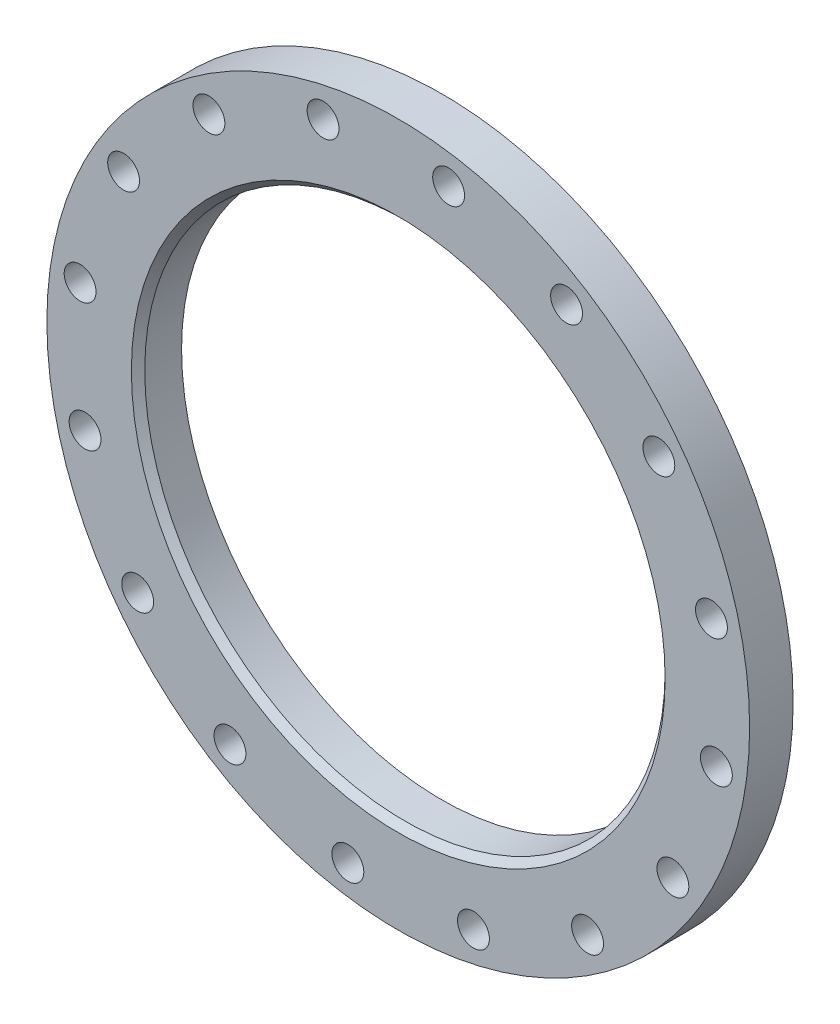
ISO-10303-21;
HEADER;
FILE_DESCRIPTION(('STEP AP214'),'2;1');
FILE_NAME('part.step','',(''),(''),'','','');
FILE_SCHEMA(('AUTOMOTIVE_DESIGN { 1 0 10303 214 1 1 1 1 }'));
ENDSEC;
DATA;
#1=APPLICATION_CONTEXT('core data for automotive mechanical design processes');
#2=APPLICATION_PROTOCOL_DEFINITION('international standard','automotive_design',2000,#1);
#3=PRODUCT_CONTEXT('',#1,'mechanical');
#4=PRODUCT('Part','Part','',(#3));
#5=PRODUCT_RELATED_PRODUCT_CATEGORY('part','',(#4));
#6=PRODUCT_DEFINITION_FORMATION('','',#4);
#7=PRODUCT_DEFINITION_CONTEXT('part definition',#1,'design');
#8=PRODUCT_DEFINITION('design','',#6,#7);
#9=PRODUCT_DEFINITION_SHAPE('','',#8);
#10=(LENGTH_UNIT() NAMED_UNIT(*) SI_UNIT(.MILLI.,.METRE.));
#11=(NAMED_UNIT(*) PLANE_ANGLE_UNIT() SI_UNIT($,.RADIAN.));
#12=(NAMED_UNIT(*) SI_UNIT($,.STERADIAN.) SOLID_ANGLE_UNIT());
#13=UNCERTAINTY_MEASURE_WITH_UNIT(LENGTH_MEASURE(1.E-05),#10,'distance_accuracy_value','');
#14=(GEOMETRIC_REPRESENTATION_CONTEXT(3) GLOBAL_UNCERTAINTY_ASSIGNED_CONTEXT((#13)) GLOBAL_UNIT_ASSIGNED_CONTEXT((#10,
#11,#12)) REPRESENTATION_CONTEXT('',''));
#15=CARTESIAN_POINT('',(0.,0.,0.));
#16=DIRECTION('',(0.,0.,1.));
#17=DIRECTION('',(1.,0.,0.));
#18=AXIS2_PLACEMENT_3D('',#15,#16,#17);
#19=CARTESIAN_POINT('',(0.,0.,52.));
#20=DIRECTION('',(0.,0.,1.));
#21=DIRECTION('',(1.,0.,0.));
#22=AXIS2_PLACEMENT_3D('',#19,#20,#21);
#23=PLANE('',#22);
#24=CARTESIAN_POINT('',(-89.8764650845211,374.362419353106,52.));
#25=DIRECTION('',(0.,0.,1.));
#26=DIRECTION('',(0.923879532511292,0.382683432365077,0.));
#27=AXIS2_PLACEMENT_3D('',#24,#25,#26);
#28=CIRCLE('',#27,19.05);
#29=CARTESIAN_POINT('',(-70.8264650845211,374.362419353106,52.));
#30=VERTEX_POINT('',#29);
#31=EDGE_CURVE('E148',#30,#30,#28,.T.);
#32=ORIENTED_EDGE('',*,*,#31,.F.);
#33=EDGE_LOOP('',(#32));
#34=FACE_BOUND('',#33,.T.);
#35=CARTESIAN_POINT('',(-226.2973221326,311.471542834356,52.));
#36=DIRECTION('',(0.,0.,1.));
#37=DIRECTION('',(0.707106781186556,0.707106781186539,0.));
#38=AXIS2_PLACEMENT_3D('',#35,#36,#37);
#39=CIRCLE('',#38,19.05);
#40=CARTESIAN_POINT('',(-207.247322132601,311.471542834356,52.));
#41=VERTEX_POINT('',#40);
#42=EDGE_CURVE('E142',#41,#41,#39,.T.);
#43=ORIENTED_EDGE('',*,*,#42,.F.);
#44=EDGE_LOOP('',(#43));
#45=FACE_BOUND('',#44,.T.);
#46=CARTESIAN_POINT('',(-328.266463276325,201.161947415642,52.));
#47=DIRECTION('',(0.,0.,1.));
#48=DIRECTION('',(0.3826834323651,0.923879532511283,0.));
#49=AXIS2_PLACEMENT_3D('',#46,#47,#48);
#50=CIRCLE('',#49,19.05);
#51=CARTESIAN_POINT('',(-309.216463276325,201.161947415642,52.));
#52=VERTEX_POINT('',#51);
#53=EDGE_CURVE('E136',#52,#52,#50,.T.);
#54=ORIENTED_EDGE('',*,*,#53,.F.);
#55=EDGE_LOOP('',(#54));
#56=FACE_BOUND('',#55,.T.);
#57=CARTESIAN_POINT('',(-380.260011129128,60.2272690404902,52.));
#58=DIRECTION('',(0.,0.,1.));
#59=DIRECTION('',(0.,1.,0.));
#60=AXIS2_PLACEMENT_3D('',#57,#58,#59);
#61=CIRCLE('',#60,19.05);
#62=CARTESIAN_POINT('',(-361.210011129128,60.2272690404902,52.));
#63=VERTEX_POINT('',#62);
#64=EDGE_CURVE('E130',#63,#63,#61,.T.);
#65=ORIENTED_EDGE('',*,*,#64,.F.);
#66=EDGE_LOOP('',(#65));
#67=FACE_BOUND('',#66,.T.);
#68=CARTESIAN_POINT('',(-374.362419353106,-89.8764650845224,52.));
#69=DIRECTION('',(0.,0.,1.));
#70=DIRECTION('',(-0.382683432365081,0.923879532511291,0.));
#71=AXIS2_PLACEMENT_3D('',#68,#69,#70);
#72=CIRCLE('',#71,19.05);
#73=CARTESIAN_POINT('',(-355.312419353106,-89.8764650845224,52.));
#74=VERTEX_POINT('',#73);
#75=EDGE_CURVE('E124',#74,#74,#72,.T.);
#76=ORIENTED_EDGE('',*,*,#75,.F.);
#77=EDGE_LOOP('',(#76));
#78=FACE_BOUND('',#77,.T.);
#79=CARTESIAN_POINT('',(-311.471542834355,-226.297322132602,52.));
#80=DIRECTION('',(0.,0.,1.));
#81=DIRECTION('',(-0.707106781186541,0.707106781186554,0.));
#82=AXIS2_PLACEMENT_3D('',#79,#80,#81);
#83=CIRCLE('',#82,19.05);
#84=CARTESIAN_POINT('',(-292.421542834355,-226.297322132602,52.));
#85=VERTEX_POINT('',#84);
#86=EDGE_CURVE('E118',#85,#85,#83,.T.);
#87=ORIENTED_EDGE('',*,*,#86,.F.);
#88=EDGE_LOOP('',(#87));
#89=FACE_BOUND('',#88,.T.);
#90=CARTESIAN_POINT('',(-201.161947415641,-328.266463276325,52.));
#91=DIRECTION('',(0.,0.,1.));
#92=DIRECTION('',(-0.923879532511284,0.382683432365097,0.));
#93=AXIS2_PLACEMENT_3D('',#90,#91,#92);
#94=CIRCLE('',#93,19.05);
#95=CARTESIAN_POINT('',(-182.111947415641,-328.266463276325,52.));
#96=VERTEX_POINT('',#95);
#97=EDGE_CURVE('E112',#96,#96,#94,.T.);
#98=ORIENTED_EDGE('',*,*,#97,.F.);
#99=EDGE_LOOP('',(#98));
#100=FACE_BOUND('',#99,.T.);
#101=CARTESIAN_POINT('',(-60.2272690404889,-380.260011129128,52.));
#102=DIRECTION('',(0.,0.,1.));
#103=DIRECTION('',(-1.,0.,0.));
#104=AXIS2_PLACEMENT_3D('',#101,#102,#103);
#105=CIRCLE('',#104,19.05);
#106=CARTESIAN_POINT('',(-41.1772690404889,-380.260011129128,52.));
#107=VERTEX_POINT('',#106);
#108=EDGE_CURVE('E106',#107,#107,#105,.T.);
#109=ORIENTED_EDGE('',*,*,#108,.F.);
#110=EDGE_LOOP('',(#109));
#111=FACE_BOUND('',#110,.T.);
#112=CARTESIAN_POINT('',(89.8764650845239,-374.362419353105,52.));
#113=DIRECTION('',(0.,0.,1.));
#114=DIRECTION('',(-0.923879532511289,-0.382683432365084,0.));
#115=AXIS2_PLACEMENT_3D('',#112,#113,#114);
#116=CIRCLE('',#115,19.05);
#117=CARTESIAN_POINT('',(108.926465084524,-374.362419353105,52.));
#118=VERTEX_POINT('',#117);
#119=EDGE_CURVE('E100',#118,#118,#116,.T.);
#120=ORIENTED_EDGE('',*,*,#119,.F.);
#121=EDGE_LOOP('',(#120));
#122=FACE_BOUND('',#121,.T.);
#123=CARTESIAN_POINT('',(226.297322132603,-311.471542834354,52.));
#124=DIRECTION('',(0.,0.,1.));
#125=DIRECTION('',(-0.707106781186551,-0.707106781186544,0.));
#126=AXIS2_PLACEMENT_3D('',#123,#124,#125);
#127=CIRCLE('',#126,19.05);
#128=CARTESIAN_POINT('',(245.347322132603,-311.471542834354,52.));
#129=VERTEX_POINT('',#128);
#130=EDGE_CURVE('E94',#129,#129,#127,.T.);
#131=ORIENTED_EDGE('',*,*,#130,.F.);
#132=EDGE_LOOP('',(#131));
#133=FACE_BOUND('',#132,.T.);
#134=CARTESIAN_POINT('',(328.266463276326,-201.16194741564,52.));
#135=DIRECTION('',(0.,0.,1.));
#136=DIRECTION('',(-0.382683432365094,-0.923879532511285,0.));
#137=AXIS2_PLACEMENT_3D('',#134,#135,#136);
#138=CIRCLE('',#137,19.05);
#139=CARTESIAN_POINT('',(347.316463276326,-201.16194741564,52.));
#140=VERTEX_POINT('',#139);
#141=EDGE_CURVE('E88',#140,#140,#138,.T.);
#142=ORIENTED_EDGE('',*,*,#141,.F.);
#143=EDGE_LOOP('',(#142));
#144=FACE_BOUND('',#143,.T.);
#145=CARTESIAN_POINT('',(380.260011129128,-60.2272690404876,52.));
#146=DIRECTION('',(0.,0.,1.));
#147=DIRECTION('',(0.,-1.,0.));
#148=AXIS2_PLACEMENT_3D('',#145,#146,#147);
#149=CIRCLE('',#148,19.05);
#150=CARTESIAN_POINT('',(399.310011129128,-60.2272690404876,52.));
#151=VERTEX_POINT('',#150);
#152=EDGE_CURVE('E82',#151,#151,#149,.T.);
#153=ORIENTED_EDGE('',*,*,#152,.F.);
#154=EDGE_LOOP('',(#153));
#155=FACE_BOUND('',#154,.T.);
#156=CARTESIAN_POINT('',(374.362419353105,89.8764650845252,52.));
#157=DIRECTION('',(0.,0.,1.));
#158=DIRECTION('',(0.382683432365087,-0.923879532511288,0.));
#159=AXIS2_PLACEMENT_3D('',#156,#157,#158);
#160=CIRCLE('',#159,19.05);
#161=CARTESIAN_POINT('',(393.412419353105,89.8764650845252,52.));
#162=VERTEX_POINT('',#161);
#163=EDGE_CURVE('E76',#162,#162,#160,.T.);
#164=ORIENTED_EDGE('',*,*,#163,.F.);
#165=EDGE_LOOP('',(#164));
#166=FACE_BOUND('',#165,.T.);
#167=CARTESIAN_POINT('',(311.471542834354,226.297322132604,52.));
#168=DIRECTION('',(0.,0.,1.));
#169=DIRECTION('',(0.707106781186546,-0.707106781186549,0.));
#170=AXIS2_PLACEMENT_3D('',#167,#168,#169);
#171=CIRCLE('',#170,19.05);
#172=CARTESIAN_POINT('',(330.521542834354,226.297322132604,52.));
#173=VERTEX_POINT('',#172);
#174=EDGE_CURVE('E70',#173,#173,#171,.T.);
#175=ORIENTED_EDGE('',*,*,#174,.F.);
#176=EDGE_LOOP('',(#175));
#177=FACE_BOUND('',#176,.T.);
#178=CARTESIAN_POINT('',(201.161947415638,328.266463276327,52.));
#179=DIRECTION('',(0.,0.,1.));
#180=DIRECTION('',(0.923879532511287,-0.382683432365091,0.));
#181=AXIS2_PLACEMENT_3D('',#178,#179,#180);
#182=CIRCLE('',#181,19.05);
#183=CARTESIAN_POINT('',(220.211947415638,328.266463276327,52.));
#184=VERTEX_POINT('',#183);
#185=EDGE_CURVE('E64',#184,#184,#182,.T.);
#186=ORIENTED_EDGE('',*,*,#185,.F.);
#187=EDGE_LOOP('',(#186));
#188=FACE_BOUND('',#187,.T.);
#189=CARTESIAN_POINT('',(60.2272690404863,380.260011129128,52.));
#190=DIRECTION('',(0.,0.,1.));
#191=DIRECTION('',(1.,0.,0.));
#192=AXIS2_PLACEMENT_3D('',#189,#190,#191);
#193=CIRCLE('',#192,19.05);
#194=CARTESIAN_POINT('',(79.2772690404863,380.260011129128,52.));
#195=VERTEX_POINT('',#194);
#196=EDGE_CURVE('E58',#195,#195,#193,.T.);
#197=ORIENTED_EDGE('',*,*,#196,.F.);
#198=EDGE_LOOP('',(#197));
#199=FACE_BOUND('',#198,.T.);
#200=CARTESIAN_POINT('',(0.,0.,52.));
#201=DIRECTION('',(0.,0.,1.));
#202=DIRECTION('',(1.,0.,0.));
#203=AXIS2_PLACEMENT_3D('',#200,#201,#202);
#204=CIRCLE('',#203,319.000000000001);
#205=CARTESIAN_POINT('',(319.000000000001,0.,52.));
#206=VERTEX_POINT('',#205);
#207=EDGE_CURVE('E10',#206,#206,#204,.F.);
#208=ORIENTED_EDGE('',*,*,#207,.T.);
#209=EDGE_LOOP('',(#208));
#210=FACE_BOUND('',#209,.T.);
#211=CARTESIAN_POINT('',(0.,0.,52.));
#212=DIRECTION('',(0.,0.,1.));
#213=DIRECTION('',(1.,0.,0.));
#214=AXIS2_PLACEMENT_3D('',#211,#212,#213);
#215=CIRCLE('',#214,420.);
#216=CARTESIAN_POINT('',(-420.,0.,52.));
#217=VERTEX_POINT('',#216);
#218=EDGE_CURVE('E45',#217,#217,#215,.T.);
#219=ORIENTED_EDGE('',*,*,#218,.T.);
#220=EDGE_LOOP('',(#219));
#221=FACE_BOUND('',#220,.T.);
#222=ADVANCED_FACE('F34',(#34,#45,#56,#67,#78,#89,#100,#111,#122,#133,#144,#155,#166,#177,#188,
#199,#210,#221),#23,.T.);
#223=CARTESIAN_POINT('',(0.,0.,0.));
#224=DIRECTION('',(0.,0.,1.));
#225=DIRECTION('',(1.,0.,0.));
#226=AXIS2_PLACEMENT_3D('',#223,#224,#225);
#227=PLANE('',#226);
#228=CARTESIAN_POINT('',(-89.8764650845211,374.362419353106,0.));
#229=DIRECTION('',(0.,0.,1.));
#230=DIRECTION('',(0.923879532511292,0.382683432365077,0.));
#231=AXIS2_PLACEMENT_3D('',#228,#229,#230);
#232=CIRCLE('',#231,19.05);
#233=CARTESIAN_POINT('',(-70.8264650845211,374.362419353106,0.));
#234=VERTEX_POINT('',#233);
#235=EDGE_CURVE('E145',#234,#234,#232,.T.);
#236=ORIENTED_EDGE('',*,*,#235,.T.);
#237=EDGE_LOOP('',(#236));
#238=FACE_BOUND('',#237,.T.);
#239=CARTESIAN_POINT('',(-226.2973221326,311.471542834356,0.));
#240=DIRECTION('',(0.,0.,1.));
#241=DIRECTION('',(0.707106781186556,0.707106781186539,0.));
#242=AXIS2_PLACEMENT_3D('',#239,#240,#241);
#243=CIRCLE('',#242,19.05);
#244=CARTESIAN_POINT('',(-207.247322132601,311.471542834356,0.));
#245=VERTEX_POINT('',#244);
#246=EDGE_CURVE('E139',#245,#245,#243,.T.);
#247=ORIENTED_EDGE('',*,*,#246,.T.);
#248=EDGE_LOOP('',(#247));
#249=FACE_BOUND('',#248,.T.);
#250=CARTESIAN_POINT('',(-328.266463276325,201.161947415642,0.));
#251=DIRECTION('',(0.,0.,1.));
#252=DIRECTION('',(0.3826834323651,0.923879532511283,0.));
#253=AXIS2_PLACEMENT_3D('',#250,#251,#252);
#254=CIRCLE('',#253,19.05);
#255=CARTESIAN_POINT('',(-309.216463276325,201.161947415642,0.));
#256=VERTEX_POINT('',#255);
#257=EDGE_CURVE('E133',#256,#256,#254,.T.);
#258=ORIENTED_EDGE('',*,*,#257,.T.);
#259=EDGE_LOOP('',(#258));
#260=FACE_BOUND('',#259,.T.);
#261=CARTESIAN_POINT('',(-380.260011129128,60.2272690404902,0.));
#262=DIRECTION('',(0.,0.,1.));
#263=DIRECTION('',(0.,1.,0.));
#264=AXIS2_PLACEMENT_3D('',#261,#262,#263);
#265=CIRCLE('',#264,19.05);
#266=CARTESIAN_POINT('',(-361.210011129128,60.2272690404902,0.));
#267=VERTEX_POINT('',#266);
#268=EDGE_CURVE('E127',#267,#267,#265,.T.);
#269=ORIENTED_EDGE('',*,*,#268,.T.);
#270=EDGE_LOOP('',(#269));
#271=FACE_BOUND('',#270,.T.);
#272=CARTESIAN_POINT('',(-374.362419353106,-89.8764650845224,0.));
#273=DIRECTION('',(0.,0.,1.));
#274=DIRECTION('',(-0.382683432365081,0.923879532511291,0.));
#275=AXIS2_PLACEMENT_3D('',#272,#273,#274);
#276=CIRCLE('',#275,19.05);
#277=CARTESIAN_POINT('',(-355.312419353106,-89.8764650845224,0.));
#278=VERTEX_POINT('',#277);
#279=EDGE_CURVE('E121',#278,#278,#276,.T.);
#280=ORIENTED_EDGE('',*,*,#279,.T.);
#281=EDGE_LOOP('',(#280));
#282=FACE_BOUND('',#281,.T.);
#283=CARTESIAN_POINT('',(-311.471542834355,-226.297322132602,0.));
#284=DIRECTION('',(0.,0.,1.));
#285=DIRECTION('',(-0.707106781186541,0.707106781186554,0.));
#286=AXIS2_PLACEMENT_3D('',#283,#284,#285);
#287=CIRCLE('',#286,19.05);
#288=CARTESIAN_POINT('',(-292.421542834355,-226.297322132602,0.));
#289=VERTEX_POINT('',#288);
#290=EDGE_CURVE('E115',#289,#289,#287,.T.);
#291=ORIENTED_EDGE('',*,*,#290,.T.);
#292=EDGE_LOOP('',(#291));
#293=FACE_BOUND('',#292,.T.);
#294=CARTESIAN_POINT('',(-201.161947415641,-328.266463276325,0.));
#295=DIRECTION('',(0.,0.,1.));
#296=DIRECTION('',(-0.923879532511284,0.382683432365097,0.));
#297=AXIS2_PLACEMENT_3D('',#294,#295,#296);
#298=CIRCLE('',#297,19.05);
#299=CARTESIAN_POINT('',(-182.111947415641,-328.266463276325,0.));
#300=VERTEX_POINT('',#299);
#301=EDGE_CURVE('E109',#300,#300,#298,.T.);
#302=ORIENTED_EDGE('',*,*,#301,.T.);
#303=EDGE_LOOP('',(#302));
#304=FACE_BOUND('',#303,.T.);
#305=CARTESIAN_POINT('',(-60.2272690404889,-380.260011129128,0.));
#306=DIRECTION('',(0.,0.,1.));
#307=DIRECTION('',(-1.,0.,0.));
#308=AXIS2_PLACEMENT_3D('',#305,#306,#307);
#309=CIRCLE('',#308,19.05);
#310=CARTESIAN_POINT('',(-41.1772690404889,-380.260011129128,0.));
#311=VERTEX_POINT('',#310);
#312=EDGE_CURVE('E103',#311,#311,#309,.T.);
#313=ORIENTED_EDGE('',*,*,#312,.T.);
#314=EDGE_LOOP('',(#313));
#315=FACE_BOUND('',#314,.T.);
#316=CARTESIAN_POINT('',(89.8764650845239,-374.362419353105,0.));
#317=DIRECTION('',(0.,0.,1.));
#318=DIRECTION('',(-0.923879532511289,-0.382683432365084,0.));
#319=AXIS2_PLACEMENT_3D('',#316,#317,#318);
#320=CIRCLE('',#319,19.05);
#321=CARTESIAN_POINT('',(108.926465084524,-374.362419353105,0.));
#322=VERTEX_POINT('',#321);
#323=EDGE_CURVE('E97',#322,#322,#320,.T.);
#324=ORIENTED_EDGE('',*,*,#323,.T.);
#325=EDGE_LOOP('',(#324));
#326=FACE_BOUND('',#325,.T.);
#327=CARTESIAN_POINT('',(226.297322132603,-311.471542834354,0.));
#328=DIRECTION('',(0.,0.,1.));
#329=DIRECTION('',(-0.707106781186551,-0.707106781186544,0.));
#330=AXIS2_PLACEMENT_3D('',#327,#328,#329);
#331=CIRCLE('',#330,19.05);
#332=CARTESIAN_POINT('',(245.347322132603,-311.471542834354,0.));
#333=VERTEX_POINT('',#332);
#334=EDGE_CURVE('E91',#333,#333,#331,.T.);
#335=ORIENTED_EDGE('',*,*,#334,.T.);
#336=EDGE_LOOP('',(#335));
#337=FACE_BOUND('',#336,.T.);
#338=CARTESIAN_POINT('',(328.266463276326,-201.16194741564,0.));
#339=DIRECTION('',(0.,0.,1.));
#340=DIRECTION('',(-0.382683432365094,-0.923879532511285,0.));
#341=AXIS2_PLACEMENT_3D('',#338,#339,#340);
#342=CIRCLE('',#341,19.05);
#343=CARTESIAN_POINT('',(347.316463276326,-201.16194741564,0.));
#344=VERTEX_POINT('',#343);
#345=EDGE_CURVE('E85',#344,#344,#342,.T.);
#346=ORIENTED_EDGE('',*,*,#345,.T.);
#347=EDGE_LOOP('',(#346));
#348=FACE_BOUND('',#347,.T.);
#349=CARTESIAN_POINT('',(380.260011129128,-60.2272690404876,0.));
#350=DIRECTION('',(0.,0.,1.));
#351=DIRECTION('',(0.,-1.,0.));
#352=AXIS2_PLACEMENT_3D('',#349,#350,#351);
#353=CIRCLE('',#352,19.05);
#354=CARTESIAN_POINT('',(399.310011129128,-60.2272690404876,0.));
#355=VERTEX_POINT('',#354);
#356=EDGE_CURVE('E79',#355,#355,#353,.T.);
#357=ORIENTED_EDGE('',*,*,#356,.T.);
#358=EDGE_LOOP('',(#357));
#359=FACE_BOUND('',#358,.T.);
#360=CARTESIAN_POINT('',(374.362419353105,89.8764650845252,0.));
#361=DIRECTION('',(0.,0.,1.));
#362=DIRECTION('',(0.382683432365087,-0.923879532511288,0.));
#363=AXIS2_PLACEMENT_3D('',#360,#361,#362);
#364=CIRCLE('',#363,19.05);
#365=CARTESIAN_POINT('',(393.412419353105,89.8764650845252,0.));
#366=VERTEX_POINT('',#365);
#367=EDGE_CURVE('E73',#366,#366,#364,.T.);
#368=ORIENTED_EDGE('',*,*,#367,.T.);
#369=EDGE_LOOP('',(#368));
#370=FACE_BOUND('',#369,.T.);
#371=CARTESIAN_POINT('',(311.471542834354,226.297322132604,0.));
#372=DIRECTION('',(0.,0.,1.));
#373=DIRECTION('',(0.707106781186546,-0.707106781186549,0.));
#374=AXIS2_PLACEMENT_3D('',#371,#372,#373);
#375=CIRCLE('',#374,19.05);
#376=CARTESIAN_POINT('',(330.521542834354,226.297322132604,0.));
#377=VERTEX_POINT('',#376);
#378=EDGE_CURVE('E67',#377,#377,#375,.T.);
#379=ORIENTED_EDGE('',*,*,#378,.T.);
#380=EDGE_LOOP('',(#379));
#381=FACE_BOUND('',#380,.T.);
#382=CARTESIAN_POINT('',(201.161947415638,328.266463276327,0.));
#383=DIRECTION('',(0.,0.,1.));
#384=DIRECTION('',(0.923879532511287,-0.382683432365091,0.));
#385=AXIS2_PLACEMENT_3D('',#382,#383,#384);
#386=CIRCLE('',#385,19.05);
#387=CARTESIAN_POINT('',(220.211947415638,328.266463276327,0.));
#388=VERTEX_POINT('',#387);
#389=EDGE_CURVE('E61',#388,#388,#386,.T.);
#390=ORIENTED_EDGE('',*,*,#389,.T.);
#391=EDGE_LOOP('',(#390));
#392=FACE_BOUND('',#391,.T.);
#393=CARTESIAN_POINT('',(60.2272690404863,380.260011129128,0.));
#394=DIRECTION('',(0.,0.,1.));
#395=DIRECTION('',(1.,0.,0.));
#396=AXIS2_PLACEMENT_3D('',#393,#394,#395);
#397=CIRCLE('',#396,19.05);
#398=CARTESIAN_POINT('',(79.2772690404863,380.260011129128,0.));
#399=VERTEX_POINT('',#398);
#400=EDGE_CURVE('E57',#399,#399,#397,.T.);
#401=ORIENTED_EDGE('',*,*,#400,.T.);
#402=EDGE_LOOP('',(#401));
#403=FACE_BOUND('',#402,.T.);
#404=CARTESIAN_POINT('',(0.,0.,0.));
#405=DIRECTION('',(0.,0.,1.));
#406=DIRECTION('',(1.,0.,0.));
#407=AXIS2_PLACEMENT_3D('',#404,#405,#406);
#408=CIRCLE('',#407,420.);
#409=CARTESIAN_POINT('',(-420.,0.,0.));
#410=VERTEX_POINT('',#409);
#411=EDGE_CURVE('E49',#410,#410,#408,.T.);
#412=ORIENTED_EDGE('',*,*,#411,.F.);
#413=EDGE_LOOP('',(#412));
#414=FACE_BOUND('',#413,.T.);
#415=CARTESIAN_POINT('',(0.,0.,0.));
#416=DIRECTION('',(0.,0.,1.));
#417=DIRECTION('',(1.,0.,0.));
#418=AXIS2_PLACEMENT_3D('',#415,#416,#417);
#419=CIRCLE('',#418,311.);
#420=CARTESIAN_POINT('',(-311.,0.,0.));
#421=VERTEX_POINT('',#420);
#422=EDGE_CURVE('E53',#421,#421,#419,.T.);
#423=ORIENTED_EDGE('',*,*,#422,.T.);
#424=EDGE_LOOP('',(#423));
#425=FACE_BOUND('',#424,.T.);
#426=ADVANCED_FACE('F154',(#238,#249,#260,#271,#282,#293,#304,#315,#326,#337,#348,#359,#370,
#381,#392,#403,#414,#425),#227,.F.);
#427=CARTESIAN_POINT('',(0.,0.,52.));
#428=DIRECTION('',(0.,0.,-1.));
#429=DIRECTION('',(-1.,0.,0.));
#430=AXIS2_PLACEMENT_3D('',#427,#428,#429);
#431=CYLINDRICAL_SURFACE('',#430,420.);
#432=CARTESIAN_POINT('',(-420.,0.,52.));
#433=CARTESIAN_POINT('',(-420.,0.,51.4583333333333));
#434=CARTESIAN_POINT('',(-420.,0.,50.9166666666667));
#435=CARTESIAN_POINT('',(-420.,0.,49.8333333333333));
#436=CARTESIAN_POINT('',(-420.,0.,49.2916666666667));
#437=CARTESIAN_POINT('',(-420.,0.,48.2083333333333));
#438=CARTESIAN_POINT('',(-420.,0.,47.6666666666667));
#439=CARTESIAN_POINT('',(-420.,0.,46.5833333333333));
#440=CARTESIAN_POINT('',(-420.,0.,46.0416666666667));
#441=CARTESIAN_POINT('',(-420.,0.,44.9583333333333));
#442=CARTESIAN_POINT('',(-420.,0.,44.4166666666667));
#443=CARTESIAN_POINT('',(-420.,0.,43.3333333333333));
#444=CARTESIAN_POINT('',(-420.,0.,42.7916666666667));
#445=CARTESIAN_POINT('',(-420.,0.,41.7083333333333));
#446=CARTESIAN_POINT('',(-420.,0.,41.1666666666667));
#447=CARTESIAN_POINT('',(-420.,0.,40.0833333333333));
#448=CARTESIAN_POINT('',(-420.,0.,39.5416666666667));
#449=CARTESIAN_POINT('',(-420.,0.,38.4583333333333));
#450=CARTESIAN_POINT('',(-420.,0.,37.9166666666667));
#451=CARTESIAN_POINT('',(-420.,0.,36.8333333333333));
#452=CARTESIAN_POINT('',(-420.,0.,36.2916666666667));
#453=CARTESIAN_POINT('',(-420.,0.,35.2083333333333));
#454=CARTESIAN_POINT('',(-420.,0.,34.6666666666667));
#455=CARTESIAN_POINT('',(-420.,0.,33.5833333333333));
#456=CARTESIAN_POINT('',(-420.,0.,33.0416666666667));
#457=CARTESIAN_POINT('',(-420.,0.,31.9583333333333));
#458=CARTESIAN_POINT('',(-420.,0.,31.4166666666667));
#459=CARTESIAN_POINT('',(-420.,0.,30.3333333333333));
#460=CARTESIAN_POINT('',(-420.,0.,29.7916666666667));
#461=CARTESIAN_POINT('',(-420.,0.,28.7083333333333));
#462=CARTESIAN_POINT('',(-420.,0.,28.1666666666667));
#463=CARTESIAN_POINT('',(-420.,0.,27.0833333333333));
#464=CARTESIAN_POINT('',(-420.,0.,26.5416666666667));
#465=CARTESIAN_POINT('',(-420.,0.,25.4583333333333));
#466=CARTESIAN_POINT('',(-420.,0.,24.9166666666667));
#467=CARTESIAN_POINT('',(-420.,0.,23.8333333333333));
#468=CARTESIAN_POINT('',(-420.,0.,23.2916666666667));
#469=CARTESIAN_POINT('',(-420.,0.,22.2083333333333));
#470=CARTESIAN_POINT('',(-420.,0.,21.6666666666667));
#471=CARTESIAN_POINT('',(-420.,0.,20.5833333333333));
#472=CARTESIAN_POINT('',(-420.,0.,20.0416666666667));
#473=CARTESIAN_POINT('',(-420.,0.,18.9583333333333));
#474=CARTESIAN_POINT('',(-420.,0.,18.4166666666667));
#475=CARTESIAN_POINT('',(-420.,0.,17.3333333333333));
#476=CARTESIAN_POINT('',(-420.,0.,16.7916666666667));
#477=CARTESIAN_POINT('',(-420.,0.,15.7083333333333));
#478=CARTESIAN_POINT('',(-420.,0.,15.1666666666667));
#479=CARTESIAN_POINT('',(-420.,0.,14.0833333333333));
#480=CARTESIAN_POINT('',(-420.,0.,13.5416666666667));
#481=CARTESIAN_POINT('',(-420.,0.,12.4583333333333));
#482=CARTESIAN_POINT('',(-420.,0.,11.9166666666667));
#483=CARTESIAN_POINT('',(-420.,0.,10.8333333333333));
#484=CARTESIAN_POINT('',(-420.,0.,10.2916666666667));
#485=CARTESIAN_POINT('',(-420.,0.,9.20833333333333));
#486=CARTESIAN_POINT('',(-420.,0.,8.66666666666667));
#487=CARTESIAN_POINT('',(-420.,0.,7.58333333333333));
#488=CARTESIAN_POINT('',(-420.,0.,7.04166666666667));
#489=CARTESIAN_POINT('',(-420.,0.,5.95833333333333));
#490=CARTESIAN_POINT('',(-420.,0.,5.41666666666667));
#491=CARTESIAN_POINT('',(-420.,0.,4.33333333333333));
#492=CARTESIAN_POINT('',(-420.,0.,3.79166666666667));
#493=CARTESIAN_POINT('',(-420.,0.,2.70833333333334));
#494=CARTESIAN_POINT('',(-420.,0.,2.16666666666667));
#495=CARTESIAN_POINT('',(-420.,0.,1.08333333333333));
#496=CARTESIAN_POINT('',(-420.,0.,0.541666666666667));
#497=CARTESIAN_POINT('',(-420.,0.,0.));
#498=B_SPLINE_CURVE_WITH_KNOTS('',3,(#432,#433,#434,#435,#436,#437,#438,#439,#440,#441,#442,
#443,#444,#445,#446,#447,#448,#449,#450,#451,#452,#453,#454,#455,#456,#457,#458,#459,#460,#461,
#462,#463,#464,#465,#466,#467,#468,#469,#470,#471,#472,#473,#474,#475,#476,#477,#478,#479,#480,
#481,#482,#483,#484,#485,#486,#487,#488,#489,#490,#491,#492,#493,#494,#495,#496,#497),
.UNSPECIFIED.,.F.,.F.,(4,2,2,2,2,2,2,2,2,2,2,2,2,2,2,2,2,2,2,2,2,2,2,2,2,2,2,2,2,2,2,2,4),(0.,
1.62499999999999,3.25,4.875,6.49999999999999,8.12499999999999,9.74999999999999,11.375,13.,
14.625,16.25,17.875,19.5,21.125,22.75,24.375,26.,27.625,29.25,30.875,32.5,34.125,35.75,37.375,
39.,40.625,42.25,43.875,45.5,47.125,48.75,50.375,52.),.UNSPECIFIED.);
#499=EDGE_CURVE('BSEAM199',#217,#410,#498,.T.);
#500=ORIENTED_EDGE('',*,*,#218,.F.);
#501=ORIENTED_EDGE('',*,*,#411,.T.);
#502=ORIENTED_EDGE('',*,*,#499,.T.);
#503=ORIENTED_EDGE('',*,*,#499,.F.);
#504=EDGE_LOOP('',(#500,#502,#501,#503));
#505=FACE_BOUND('',#504,.T.);
#506=ADVANCED_FACE('F199',(#505),#431,.T.);
#507=CARTESIAN_POINT('',(0.,0.,52.));
#508=DIRECTION('',(0.,0.,-1.));
#509=DIRECTION('',(-1.,0.,0.));
#510=AXIS2_PLACEMENT_3D('',#507,#508,#509);
#511=CYLINDRICAL_SURFACE('',#510,311.);
#512=CARTESIAN_POINT('',(0.,0.,43.9999999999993));
#513=DIRECTION('',(0.,0.,1.));
#514=DIRECTION('',(1.,0.,0.));
#515=AXIS2_PLACEMENT_3D('',#512,#513,#514);
#516=CIRCLE('',#515,311.);
#517=CARTESIAN_POINT('',(-311.,0.,43.9999999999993));
#518=VERTEX_POINT('',#517);
#519=EDGE_CURVE('E41',#518,#518,#516,.T.);
#520=CARTESIAN_POINT('',(-311.,0.,43.9999999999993));
#521=CARTESIAN_POINT('',(-311.,0.,43.541666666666));
#522=CARTESIAN_POINT('',(-311.,0.,43.0833333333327));
#523=CARTESIAN_POINT('',(-311.,0.,42.166666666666));
#524=CARTESIAN_POINT('',(-311.,0.,41.7083333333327));
#525=CARTESIAN_POINT('',(-311.,0.,40.791666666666));
#526=CARTESIAN_POINT('',(-311.,0.,40.3333333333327));
#527=CARTESIAN_POINT('',(-311.,0.,39.4166666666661));
#528=CARTESIAN_POINT('',(-311.,0.,38.9583333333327));
#529=CARTESIAN_POINT('',(-311.,0.,38.0416666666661));
#530=CARTESIAN_POINT('',(-311.,0.,37.5833333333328));
#531=CARTESIAN_POINT('',(-311.,0.,36.6666666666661));
#532=CARTESIAN_POINT('',(-311.,0.,36.2083333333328));
#533=CARTESIAN_POINT('',(-311.,0.,35.2916666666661));
#534=CARTESIAN_POINT('',(-311.,0.,34.8333333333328));
#535=CARTESIAN_POINT('',(-311.,0.,33.9166666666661));
#536=CARTESIAN_POINT('',(-311.,0.,33.4583333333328));
#537=CARTESIAN_POINT('',(-311.,0.,32.5416666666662));
#538=CARTESIAN_POINT('',(-311.,0.,32.0833333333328));
#539=CARTESIAN_POINT('',(-311.,0.,31.1666666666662));
#540=CARTESIAN_POINT('',(-311.,0.,30.7083333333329));
#541=CARTESIAN_POINT('',(-311.,0.,29.7916666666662));
#542=CARTESIAN_POINT('',(-311.,0.,29.3333333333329));
#543=CARTESIAN_POINT('',(-311.,0.,28.4166666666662));
#544=CARTESIAN_POINT('',(-311.,0.,27.9583333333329));
#545=CARTESIAN_POINT('',(-311.,0.,27.0416666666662));
#546=CARTESIAN_POINT('',(-311.,0.,26.5833333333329));
#547=CARTESIAN_POINT('',(-311.,0.,25.6666666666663));
#548=CARTESIAN_POINT('',(-311.,0.,25.2083333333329));
#549=CARTESIAN_POINT('',(-311.,0.,24.2916666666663));
#550=CARTESIAN_POINT('',(-311.,0.,23.833333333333));
#551=CARTESIAN_POINT('',(-311.,0.,22.9166666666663));
#552=CARTESIAN_POINT('',(-311.,0.,22.458333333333));
#553=CARTESIAN_POINT('',(-311.,0.,21.5416666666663));
#554=CARTESIAN_POINT('',(-311.,0.,21.083333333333));
#555=CARTESIAN_POINT('',(-311.,0.,20.1666666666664));
#556=CARTESIAN_POINT('',(-311.,0.,19.708333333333));
#557=CARTESIAN_POINT('',(-311.,0.,18.7916666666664));
#558=CARTESIAN_POINT('',(-311.,0.,18.3333333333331));
#559=CARTESIAN_POINT('',(-311.,0.,17.4166666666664));
#560=CARTESIAN_POINT('',(-311.,0.,16.9583333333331));
#561=CARTESIAN_POINT('',(-311.,0.,16.0416666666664));
#562=CARTESIAN_POINT('',(-311.,0.,15.5833333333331));
#563=CARTESIAN_POINT('',(-311.,0.,14.6666666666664));
#564=CARTESIAN_POINT('',(-311.,0.,14.2083333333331));
#565=CARTESIAN_POINT('',(-311.,0.,13.2916666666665));
#566=CARTESIAN_POINT('',(-311.,0.,12.8333333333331));
#567=CARTESIAN_POINT('',(-311.,0.,11.9166666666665));
#568=CARTESIAN_POINT('',(-311.,0.,11.4583333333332));
#569=CARTESIAN_POINT('',(-311.,0.,10.5416666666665));
#570=CARTESIAN_POINT('',(-311.,0.,10.0833333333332));
#571=CARTESIAN_POINT('',(-311.,0.,9.16666666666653));
#572=CARTESIAN_POINT('',(-311.,0.,8.7083333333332));
#573=CARTESIAN_POINT('',(-311.,0.,7.79166666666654));
#574=CARTESIAN_POINT('',(-311.,0.,7.33333333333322));
#575=CARTESIAN_POINT('',(-311.,0.,6.41666666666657));
#576=CARTESIAN_POINT('',(-311.,0.,5.95833333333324));
#577=CARTESIAN_POINT('',(-311.,0.,5.04166666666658));
#578=CARTESIAN_POINT('',(-311.,0.,4.58333333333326));
#579=CARTESIAN_POINT('',(-311.,0.,3.66666666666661));
#580=CARTESIAN_POINT('',(-311.,0.,3.20833333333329));
#581=CARTESIAN_POINT('',(-311.,0.,2.29166666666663));
#582=CARTESIAN_POINT('',(-311.,0.,1.8333333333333));
#583=CARTESIAN_POINT('',(-311.,0.,0.916666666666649));
#584=CARTESIAN_POINT('',(-311.,0.,0.458333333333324));
#585=CARTESIAN_POINT('',(-311.,0.,0.));
#586=B_SPLINE_CURVE_WITH_KNOTS('',3,(#520,#521,#522,#523,#524,#525,#526,#527,#528,#529,#530,
#531,#532,#533,#534,#535,#536,#537,#538,#539,#540,#541,#542,#543,#544,#545,#546,#547,#548,#549,
#550,#551,#552,#553,#554,#555,#556,#557,#558,#559,#560,#561,#562,#563,#564,#565,#566,#567,#568,
#569,#570,#571,#572,#573,#574,#575,#576,#577,#578,#579,#580,#581,#582,#583,#584,#585),
.UNSPECIFIED.,.F.,.F.,(4,2,2,2,2,2,2,2,2,2,2,2,2,2,2,2,2,2,2,2,2,2,2,2,2,2,2,2,2,2,2,2,4),(0.,
1.37499999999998,2.74999999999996,4.12499999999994,5.49999999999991,6.8749999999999,
8.24999999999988,9.62499999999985,10.9999999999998,12.3749999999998,13.7499999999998,
15.1249999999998,16.4999999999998,17.8749999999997,19.2499999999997,20.6249999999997,
21.9999999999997,23.3749999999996,24.7499999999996,26.1249999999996,27.4999999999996,
28.8749999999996,30.2499999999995,31.6249999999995,32.9999999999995,34.3749999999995,
35.7499999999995,37.1249999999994,38.4999999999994,39.8749999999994,41.2499999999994,
42.6249999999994,43.9999999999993),.UNSPECIFIED.);
#587=EDGE_CURVE('BSEAM202',#518,#421,#586,.T.);
#588=ORIENTED_EDGE('',*,*,#519,.T.);
#589=ORIENTED_EDGE('',*,*,#422,.F.);
#590=ORIENTED_EDGE('',*,*,#587,.T.);
#591=ORIENTED_EDGE('',*,*,#587,.F.);
#592=EDGE_LOOP('',(#588,#590,#589,#591));
#593=FACE_BOUND('',#592,.T.);
#594=ADVANCED_FACE('F202',(#593),#511,.F.);
#595=CARTESIAN_POINT('',(0.,0.,43.9999999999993));
#596=DIRECTION('',(0.,0.,1.));
#597=DIRECTION('',(1.,0.,0.));
#598=AXIS2_PLACEMENT_3D('',#595,#596,#597);
#599=CONICAL_SURFACE('',#598,311.,0.785398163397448);
#600=ORIENTED_EDGE('',*,*,#207,.F.);
#601=EDGE_LOOP('',(#600));
#602=FACE_BOUND('',#601,.T.);
#603=ORIENTED_EDGE('',*,*,#519,.F.);
#604=EDGE_LOOP('',(#603));
#605=FACE_BOUND('',#604,.T.);
#606=ADVANCED_FACE('F36',(#602,#605),#599,.F.);
#607=CARTESIAN_POINT('',(60.2272690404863,380.260011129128,0.));
#608=DIRECTION('',(0.,0.,1.));
#609=DIRECTION('',(1.,0.,0.));
#610=AXIS2_PLACEMENT_3D('',#607,#608,#609);
#611=CYLINDRICAL_SURFACE('',#610,19.05);
#612=CARTESIAN_POINT('',(79.2772690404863,380.260011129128,0.));
#613=CARTESIAN_POINT('',(79.2772690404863,380.260011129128,0.541666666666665));
#614=CARTESIAN_POINT('',(79.2772690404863,380.260011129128,1.08333333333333));
#615=CARTESIAN_POINT('',(79.2772690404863,380.260011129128,2.16666666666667));
#616=CARTESIAN_POINT('',(79.2772690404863,380.260011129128,2.70833333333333));
#617=CARTESIAN_POINT('',(79.2772690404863,380.260011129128,3.79166666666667));
#618=CARTESIAN_POINT('',(79.2772690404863,380.260011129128,4.33333333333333));
#619=CARTESIAN_POINT('',(79.2772690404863,380.260011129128,5.41666666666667));
#620=CARTESIAN_POINT('',(79.2772690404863,380.260011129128,5.95833333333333));
#621=CARTESIAN_POINT('',(79.2772690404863,380.260011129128,7.04166666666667));
#622=CARTESIAN_POINT('',(79.2772690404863,380.260011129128,7.58333333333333));
#623=CARTESIAN_POINT('',(79.2772690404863,380.260011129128,8.66666666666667));
#624=CARTESIAN_POINT('',(79.2772690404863,380.260011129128,9.20833333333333));
#625=CARTESIAN_POINT('',(79.2772690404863,380.260011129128,10.2916666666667));
#626=CARTESIAN_POINT('',(79.2772690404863,380.260011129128,10.8333333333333));
#627=CARTESIAN_POINT('',(79.2772690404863,380.260011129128,11.9166666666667));
#628=CARTESIAN_POINT('',(79.2772690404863,380.260011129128,12.4583333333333));
#629=CARTESIAN_POINT('',(79.2772690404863,380.260011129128,13.5416666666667));
#630=CARTESIAN_POINT('',(79.2772690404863,380.260011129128,14.0833333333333));
#631=CARTESIAN_POINT('',(79.2772690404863,380.260011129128,15.1666666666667));
#632=CARTESIAN_POINT('',(79.2772690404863,380.260011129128,15.7083333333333));
#633=CARTESIAN_POINT('',(79.2772690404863,380.260011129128,16.7916666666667));
#634=CARTESIAN_POINT('',(79.2772690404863,380.260011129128,17.3333333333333));
#635=CARTESIAN_POINT('',(79.2772690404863,380.260011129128,18.4166666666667));
#636=CARTESIAN_POINT('',(79.2772690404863,380.260011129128,18.9583333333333));
#637=CARTESIAN_POINT('',(79.2772690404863,380.260011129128,20.0416666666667));
#638=CARTESIAN_POINT('',(79.2772690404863,380.260011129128,20.5833333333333));
#639=CARTESIAN_POINT('',(79.2772690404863,380.260011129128,21.6666666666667));
#640=CARTESIAN_POINT('',(79.2772690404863,380.260011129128,22.2083333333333));
#641=CARTESIAN_POINT('',(79.2772690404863,380.260011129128,23.2916666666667));
#642=CARTESIAN_POINT('',(79.2772690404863,380.260011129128,23.8333333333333));
#643=CARTESIAN_POINT('',(79.2772690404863,380.260011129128,24.9166666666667));
#644=CARTESIAN_POINT('',(79.2772690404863,380.260011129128,25.4583333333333));
#645=CARTESIAN_POINT('',(79.2772690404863,380.260011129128,26.5416666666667));
#646=CARTESIAN_POINT('',(79.2772690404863,380.260011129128,27.0833333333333));
#647=CARTESIAN_POINT('',(79.2772690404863,380.260011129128,28.1666666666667));
#648=CARTESIAN_POINT('',(79.2772690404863,380.260011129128,28.7083333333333));
#649=CARTESIAN_POINT('',(79.2772690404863,380.260011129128,29.7916666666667));
#650=CARTESIAN_POINT('',(79.2772690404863,380.260011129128,30.3333333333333));
#651=CARTESIAN_POINT('',(79.2772690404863,380.260011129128,31.4166666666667));
#652=CARTESIAN_POINT('',(79.2772690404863,380.260011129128,31.9583333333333));
#653=CARTESIAN_POINT('',(79.2772690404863,380.260011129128,33.0416666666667));
#654=CARTESIAN_POINT('',(79.2772690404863,380.260011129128,33.5833333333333));
#655=CARTESIAN_POINT('',(79.2772690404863,380.260011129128,34.6666666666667));
#656=CARTESIAN_POINT('',(79.2772690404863,380.260011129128,35.2083333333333));
#657=CARTESIAN_POINT('',(79.2772690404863,380.260011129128,36.2916666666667));
#658=CARTESIAN_POINT('',(79.2772690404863,380.260011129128,36.8333333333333));
#659=CARTESIAN_POINT('',(79.2772690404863,380.260011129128,37.9166666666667));
#660=CARTESIAN_POINT('',(79.2772690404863,380.260011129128,38.4583333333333));
#661=CARTESIAN_POINT('',(79.2772690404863,380.260011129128,39.5416666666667));
#662=CARTESIAN_POINT('',(79.2772690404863,380.260011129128,40.0833333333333));
#663=CARTESIAN_POINT('',(79.2772690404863,380.260011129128,41.1666666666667));
#664=CARTESIAN_POINT('',(79.2772690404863,380.260011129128,41.7083333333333));
#665=CARTESIAN_POINT('',(79.2772690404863,380.260011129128,42.7916666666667));
#666=CARTESIAN_POINT('',(79.2772690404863,380.260011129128,43.3333333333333));
#667=CARTESIAN_POINT('',(79.2772690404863,380.260011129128,44.4166666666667));
#668=CARTESIAN_POINT('',(79.2772690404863,380.260011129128,44.9583333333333));
#669=CARTESIAN_POINT('',(79.2772690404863,380.260011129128,46.0416666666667));
#670=CARTESIAN_POINT('',(79.2772690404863,380.260011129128,46.5833333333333));
#671=CARTESIAN_POINT('',(79.2772690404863,380.260011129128,47.6666666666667));
#672=CARTESIAN_POINT('',(79.2772690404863,380.260011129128,48.2083333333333));
#673=CARTESIAN_POINT('',(79.2772690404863,380.260011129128,49.2916666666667));
#674=CARTESIAN_POINT('',(79.2772690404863,380.260011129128,49.8333333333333));
#675=CARTESIAN_POINT('',(79.2772690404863,380.260011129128,50.9166666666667));
#676=CARTESIAN_POINT('',(79.2772690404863,380.260011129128,51.4583333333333));
#677=CARTESIAN_POINT('',(79.2772690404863,380.260011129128,52.));
#678=B_SPLINE_CURVE_WITH_KNOTS('',3,(#612,#613,#614,#615,#616,#617,#618,#619,#620,#621,#622,
#623,#624,#625,#626,#627,#628,#629,#630,#631,#632,#633,#634,#635,#636,#637,#638,#639,#640,#641,
#642,#643,#644,#645,#646,#647,#648,#649,#650,#651,#652,#653,#654,#655,#656,#657,#658,#659,#660,
#661,#662,#663,#664,#665,#666,#667,#668,#669,#670,#671,#672,#673,#674,#675,#676,#677),
.UNSPECIFIED.,.F.,.F.,(4,2,2,2,2,2,2,2,2,2,2,2,2,2,2,2,2,2,2,2,2,2,2,2,2,2,2,2,2,2,2,2,4),(0.,
1.625,3.25,4.875,6.5,8.125,9.75,11.375,13.,14.625,16.25,17.875,19.5,21.125,22.75,24.375,26.,
27.625,29.25,30.875,32.5,34.125,35.75,37.375,39.,40.625,42.25,43.875,45.5,47.125,48.75,50.375,
52.),.UNSPECIFIED.);
#679=EDGE_CURVE('BSEAM215',#399,#195,#678,.T.);
#680=ORIENTED_EDGE('',*,*,#400,.F.);
#681=ORIENTED_EDGE('',*,*,#196,.T.);
#682=ORIENTED_EDGE('',*,*,#679,.T.);
#683=ORIENTED_EDGE('',*,*,#679,.F.);
#684=EDGE_LOOP('',(#680,#682,#681,#683));
#685=FACE_BOUND('',#684,.T.);
#686=ADVANCED_FACE('F215',(#685),#611,.F.);
#687=CARTESIAN_POINT('',(201.161947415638,328.266463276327,0.));
#688=DIRECTION('',(0.,0.,1.));
#689=DIRECTION('',(1.,0.,0.));
#690=AXIS2_PLACEMENT_3D('',#687,#688,#689);
#691=CYLINDRICAL_SURFACE('',#690,19.05);
#692=CARTESIAN_POINT('',(220.211947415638,328.266463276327,0.));
#693=CARTESIAN_POINT('',(220.211947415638,328.266463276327,0.541666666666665));
#694=CARTESIAN_POINT('',(220.211947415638,328.266463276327,1.08333333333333));
#695=CARTESIAN_POINT('',(220.211947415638,328.266463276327,2.16666666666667));
#696=CARTESIAN_POINT('',(220.211947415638,328.266463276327,2.70833333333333));
#697=CARTESIAN_POINT('',(220.211947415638,328.266463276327,3.79166666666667));
#698=CARTESIAN_POINT('',(220.211947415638,328.266463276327,4.33333333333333));
#699=CARTESIAN_POINT('',(220.211947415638,328.266463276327,5.41666666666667));
#700=CARTESIAN_POINT('',(220.211947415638,328.266463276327,5.95833333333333));
#701=CARTESIAN_POINT('',(220.211947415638,328.266463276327,7.04166666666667));
#702=CARTESIAN_POINT('',(220.211947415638,328.266463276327,7.58333333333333));
#703=CARTESIAN_POINT('',(220.211947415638,328.266463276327,8.66666666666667));
#704=CARTESIAN_POINT('',(220.211947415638,328.266463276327,9.20833333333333));
#705=CARTESIAN_POINT('',(220.211947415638,328.266463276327,10.2916666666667));
#706=CARTESIAN_POINT('',(220.211947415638,328.266463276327,10.8333333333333));
#707=CARTESIAN_POINT('',(220.211947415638,328.266463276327,11.9166666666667));
#708=CARTESIAN_POINT('',(220.211947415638,328.266463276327,12.4583333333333));
#709=CARTESIAN_POINT('',(220.211947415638,328.266463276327,13.5416666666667));
#710=CARTESIAN_POINT('',(220.211947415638,328.266463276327,14.0833333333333));
#711=CARTESIAN_POINT('',(220.211947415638,328.266463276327,15.1666666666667));
#712=CARTESIAN_POINT('',(220.211947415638,328.266463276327,15.7083333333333));
#713=CARTESIAN_POINT('',(220.211947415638,328.266463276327,16.7916666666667));
#714=CARTESIAN_POINT('',(220.211947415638,328.266463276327,17.3333333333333));
#715=CARTESIAN_POINT('',(220.211947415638,328.266463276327,18.4166666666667));
#716=CARTESIAN_POINT('',(220.211947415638,328.266463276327,18.9583333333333));
#717=CARTESIAN_POINT('',(220.211947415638,328.266463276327,20.0416666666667));
#718=CARTESIAN_POINT('',(220.211947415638,328.266463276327,20.5833333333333));
#719=CARTESIAN_POINT('',(220.211947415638,328.266463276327,21.6666666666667));
#720=CARTESIAN_POINT('',(220.211947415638,328.266463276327,22.2083333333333));
#721=CARTESIAN_POINT('',(220.211947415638,328.266463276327,23.2916666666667));
#722=CARTESIAN_POINT('',(220.211947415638,328.266463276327,23.8333333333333));
#723=CARTESIAN_POINT('',(220.211947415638,328.266463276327,24.9166666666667));
#724=CARTESIAN_POINT('',(220.211947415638,328.266463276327,25.4583333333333));
#725=CARTESIAN_POINT('',(220.211947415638,328.266463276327,26.5416666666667));
#726=CARTESIAN_POINT('',(220.211947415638,328.266463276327,27.0833333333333));
#727=CARTESIAN_POINT('',(220.211947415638,328.266463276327,28.1666666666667));
#728=CARTESIAN_POINT('',(220.211947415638,328.266463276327,28.7083333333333));
#729=CARTESIAN_POINT('',(220.211947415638,328.266463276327,29.7916666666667));
#730=CARTESIAN_POINT('',(220.211947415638,328.266463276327,30.3333333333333));
#731=CARTESIAN_POINT('',(220.211947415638,328.266463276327,31.4166666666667));
#732=CARTESIAN_POINT('',(220.211947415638,328.266463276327,31.9583333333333));
#733=CARTESIAN_POINT('',(220.211947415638,328.266463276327,33.0416666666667));
#734=CARTESIAN_POINT('',(220.211947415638,328.266463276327,33.5833333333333));
#735=CARTESIAN_POINT('',(220.211947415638,328.266463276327,34.6666666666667));
#736=CARTESIAN_POINT('',(220.211947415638,328.266463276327,35.2083333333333));
#737=CARTESIAN_POINT('',(220.211947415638,328.266463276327,36.2916666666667));
#738=CARTESIAN_POINT('',(220.211947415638,328.266463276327,36.8333333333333));
#739=CARTESIAN_POINT('',(220.211947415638,328.266463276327,37.9166666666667));
#740=CARTESIAN_POINT('',(220.211947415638,328.266463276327,38.4583333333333));
#741=CARTESIAN_POINT('',(220.211947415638,328.266463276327,39.5416666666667));
#742=CARTESIAN_POINT('',(220.211947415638,328.266463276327,40.0833333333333));
#743=CARTESIAN_POINT('',(220.211947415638,328.266463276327,41.1666666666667));
#744=CARTESIAN_POINT('',(220.211947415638,328.266463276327,41.7083333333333));
#745=CARTESIAN_POINT('',(220.211947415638,328.266463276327,42.7916666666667));
#746=CARTESIAN_POINT('',(220.211947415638,328.266463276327,43.3333333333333));
#747=CARTESIAN_POINT('',(220.211947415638,328.266463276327,44.4166666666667));
#748=CARTESIAN_POINT('',(220.211947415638,328.266463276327,44.9583333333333));
#749=CARTESIAN_POINT('',(220.211947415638,328.266463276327,46.0416666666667));
#750=CARTESIAN_POINT('',(220.211947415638,328.266463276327,46.5833333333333));
#751=CARTESIAN_POINT('',(220.211947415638,328.266463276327,47.6666666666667));
#752=CARTESIAN_POINT('',(220.211947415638,328.266463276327,48.2083333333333));
#753=CARTESIAN_POINT('',(220.211947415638,328.266463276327,49.2916666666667));
#754=CARTESIAN_POINT('',(220.211947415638,328.266463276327,49.8333333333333));
#755=CARTESIAN_POINT('',(220.211947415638,328.266463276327,50.9166666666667));
#756=CARTESIAN_POINT('',(220.211947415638,328.266463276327,51.4583333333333));
#757=CARTESIAN_POINT('',(220.211947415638,328.266463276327,52.));
#758=B_SPLINE_CURVE_WITH_KNOTS('',3,(#692,#693,#694,#695,#696,#697,#698,#699,#700,#701,#702,
#703,#704,#705,#706,#707,#708,#709,#710,#711,#712,#713,#714,#715,#716,#717,#718,#719,#720,#721,
#722,#723,#724,#725,#726,#727,#728,#729,#730,#731,#732,#733,#734,#735,#736,#737,#738,#739,#740,
#741,#742,#743,#744,#745,#746,#747,#748,#749,#750,#751,#752,#753,#754,#755,#756,#757),
.UNSPECIFIED.,.F.,.F.,(4,2,2,2,2,2,2,2,2,2,2,2,2,2,2,2,2,2,2,2,2,2,2,2,2,2,2,2,2,2,2,2,4),(0.,
1.625,3.25,4.875,6.5,8.125,9.75,11.375,13.,14.625,16.25,17.875,19.5,21.125,22.75,24.375,26.,
27.625,29.25,30.875,32.5,34.125,35.75,37.375,39.,40.625,42.25,43.875,45.5,47.125,48.75,50.375,
52.),.UNSPECIFIED.);
#759=EDGE_CURVE('BSEAM220',#388,#184,#758,.T.);
#760=ORIENTED_EDGE('',*,*,#389,.F.);
#761=ORIENTED_EDGE('',*,*,#185,.T.);
#762=ORIENTED_EDGE('',*,*,#759,.T.);
#763=ORIENTED_EDGE('',*,*,#759,.F.);
#764=EDGE_LOOP('',(#760,#762,#761,#763));
#765=FACE_BOUND('',#764,.T.);
#766=ADVANCED_FACE('F220',(#765),#691,.F.);
#767=CARTESIAN_POINT('',(311.471542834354,226.297322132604,0.));
#768=DIRECTION('',(0.,0.,1.));
#769=DIRECTION('',(1.,0.,0.));
#770=AXIS2_PLACEMENT_3D('',#767,#768,#769);
#771=CYLINDRICAL_SURFACE('',#770,19.05);
#772=CARTESIAN_POINT('',(330.521542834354,226.297322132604,0.));
#773=CARTESIAN_POINT('',(330.521542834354,226.297322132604,0.541666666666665));
#774=CARTESIAN_POINT('',(330.521542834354,226.297322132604,1.08333333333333));
#775=CARTESIAN_POINT('',(330.521542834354,226.297322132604,2.16666666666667));
#776=CARTESIAN_POINT('',(330.521542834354,226.297322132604,2.70833333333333));
#777=CARTESIAN_POINT('',(330.521542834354,226.297322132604,3.79166666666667));
#778=CARTESIAN_POINT('',(330.521542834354,226.297322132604,4.33333333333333));
#779=CARTESIAN_POINT('',(330.521542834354,226.297322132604,5.41666666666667));
#780=CARTESIAN_POINT('',(330.521542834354,226.297322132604,5.95833333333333));
#781=CARTESIAN_POINT('',(330.521542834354,226.297322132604,7.04166666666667));
#782=CARTESIAN_POINT('',(330.521542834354,226.297322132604,7.58333333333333));
#783=CARTESIAN_POINT('',(330.521542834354,226.297322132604,8.66666666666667));
#784=CARTESIAN_POINT('',(330.521542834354,226.297322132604,9.20833333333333));
#785=CARTESIAN_POINT('',(330.521542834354,226.297322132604,10.2916666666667));
#786=CARTESIAN_POINT('',(330.521542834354,226.297322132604,10.8333333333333));
#787=CARTESIAN_POINT('',(330.521542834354,226.297322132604,11.9166666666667));
#788=CARTESIAN_POINT('',(330.521542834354,226.297322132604,12.4583333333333));
#789=CARTESIAN_POINT('',(330.521542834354,226.297322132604,13.5416666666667));
#790=CARTESIAN_POINT('',(330.521542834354,226.297322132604,14.0833333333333));
#791=CARTESIAN_POINT('',(330.521542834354,226.297322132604,15.1666666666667));
#792=CARTESIAN_POINT('',(330.521542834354,226.297322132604,15.7083333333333));
#793=CARTESIAN_POINT('',(330.521542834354,226.297322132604,16.7916666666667));
#794=CARTESIAN_POINT('',(330.521542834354,226.297322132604,17.3333333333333));
#795=CARTESIAN_POINT('',(330.521542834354,226.297322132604,18.4166666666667));
#796=CARTESIAN_POINT('',(330.521542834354,226.297322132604,18.9583333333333));
#797=CARTESIAN_POINT('',(330.521542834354,226.297322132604,20.0416666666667));
#798=CARTESIAN_POINT('',(330.521542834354,226.297322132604,20.5833333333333));
#799=CARTESIAN_POINT('',(330.521542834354,226.297322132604,21.6666666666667));
#800=CARTESIAN_POINT('',(330.521542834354,226.297322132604,22.2083333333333));
#801=CARTESIAN_POINT('',(330.521542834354,226.297322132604,23.2916666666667));
#802=CARTESIAN_POINT('',(330.521542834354,226.297322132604,23.8333333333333));
#803=CARTESIAN_POINT('',(330.521542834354,226.297322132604,24.9166666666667));
#804=CARTESIAN_POINT('',(330.521542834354,226.297322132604,25.4583333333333));
#805=CARTESIAN_POINT('',(330.521542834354,226.297322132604,26.5416666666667));
#806=CARTESIAN_POINT('',(330.521542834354,226.297322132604,27.0833333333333));
#807=CARTESIAN_POINT('',(330.521542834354,226.297322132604,28.1666666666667));
#808=CARTESIAN_POINT('',(330.521542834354,226.297322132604,28.7083333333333));
#809=CARTESIAN_POINT('',(330.521542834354,226.297322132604,29.7916666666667));
#810=CARTESIAN_POINT('',(330.521542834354,226.297322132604,30.3333333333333));
#811=CARTESIAN_POINT('',(330.521542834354,226.297322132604,31.4166666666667));
#812=CARTESIAN_POINT('',(330.521542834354,226.297322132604,31.9583333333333));
#813=CARTESIAN_POINT('',(330.521542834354,226.297322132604,33.0416666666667));
#814=CARTESIAN_POINT('',(330.521542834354,226.297322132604,33.5833333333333));
#815=CARTESIAN_POINT('',(330.521542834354,226.297322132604,34.6666666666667));
#816=CARTESIAN_POINT('',(330.521542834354,226.297322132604,35.2083333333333));
#817=CARTESIAN_POINT('',(330.521542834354,226.297322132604,36.2916666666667));
#818=CARTESIAN_POINT('',(330.521542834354,226.297322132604,36.8333333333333));
#819=CARTESIAN_POINT('',(330.521542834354,226.297322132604,37.9166666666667));
#820=CARTESIAN_POINT('',(330.521542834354,226.297322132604,38.4583333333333));
#821=CARTESIAN_POINT('',(330.521542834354,226.297322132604,39.5416666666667));
#822=CARTESIAN_POINT('',(330.521542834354,226.297322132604,40.0833333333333));
#823=CARTESIAN_POINT('',(330.521542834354,226.297322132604,41.1666666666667));
#824=CARTESIAN_POINT('',(330.521542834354,226.297322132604,41.7083333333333));
#825=CARTESIAN_POINT('',(330.521542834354,226.297322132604,42.7916666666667));
#826=CARTESIAN_POINT('',(330.521542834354,226.297322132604,43.3333333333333));
#827=CARTESIAN_POINT('',(330.521542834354,226.297322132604,44.4166666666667));
#828=CARTESIAN_POINT('',(330.521542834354,226.297322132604,44.9583333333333));
#829=CARTESIAN_POINT('',(330.521542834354,226.297322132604,46.0416666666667));
#830=CARTESIAN_POINT('',(330.521542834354,226.297322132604,46.5833333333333));
#831=CARTESIAN_POINT('',(330.521542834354,226.297322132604,47.6666666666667));
#832=CARTESIAN_POINT('',(330.521542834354,226.297322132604,48.2083333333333));
#833=CARTESIAN_POINT('',(330.521542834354,226.297322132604,49.2916666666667));
#834=CARTESIAN_POINT('',(330.521542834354,226.297322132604,49.8333333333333));
#835=CARTESIAN_POINT('',(330.521542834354,226.297322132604,50.9166666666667));
#836=CARTESIAN_POINT('',(330.521542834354,226.297322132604,51.4583333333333));
#837=CARTESIAN_POINT('',(330.521542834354,226.297322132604,52.));
#838=B_SPLINE_CURVE_WITH_KNOTS('',3,(#772,#773,#774,#775,#776,#777,#778,#779,#780,#781,#782,
#783,#784,#785,#786,#787,#788,#789,#790,#791,#792,#793,#794,#795,#796,#797,#798,#799,#800,#801,
#802,#803,#804,#805,#806,#807,#808,#809,#810,#811,#812,#813,#814,#815,#816,#817,#818,#819,#820,
#821,#822,#823,#824,#825,#826,#827,#828,#829,#830,#831,#832,#833,#834,#835,#836,#837),
.UNSPECIFIED.,.F.,.F.,(4,2,2,2,2,2,2,2,2,2,2,2,2,2,2,2,2,2,2,2,2,2,2,2,2,2,2,2,2,2,2,2,4),(0.,
1.625,3.25,4.875,6.5,8.125,9.75,11.375,13.,14.625,16.25,17.875,19.5,21.125,22.75,24.375,26.,
27.625,29.25,30.875,32.5,34.125,35.75,37.375,39.,40.625,42.25,43.875,45.5,47.125,48.75,50.375,
52.),.UNSPECIFIED.);
#839=EDGE_CURVE('BSEAM224',#377,#173,#838,.T.);
#840=ORIENTED_EDGE('',*,*,#378,.F.);
#841=ORIENTED_EDGE('',*,*,#174,.T.);
#842=ORIENTED_EDGE('',*,*,#839,.T.);
#843=ORIENTED_EDGE('',*,*,#839,.F.);
#844=EDGE_LOOP('',(#840,#842,#841,#843));
#845=FACE_BOUND('',#844,.T.);
#846=ADVANCED_FACE('F224',(#845),#771,.F.);
#847=CARTESIAN_POINT('',(374.362419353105,89.8764650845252,0.));
#848=DIRECTION('',(0.,0.,1.));
#849=DIRECTION('',(1.,0.,0.));
#850=AXIS2_PLACEMENT_3D('',#847,#848,#849);
#851=CYLINDRICAL_SURFACE('',#850,19.05);
#852=CARTESIAN_POINT('',(393.412419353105,89.8764650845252,0.));
#853=CARTESIAN_POINT('',(393.412419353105,89.8764650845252,0.541666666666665));
#854=CARTESIAN_POINT('',(393.412419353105,89.8764650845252,1.08333333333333));
#855=CARTESIAN_POINT('',(393.412419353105,89.8764650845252,2.16666666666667));
#856=CARTESIAN_POINT('',(393.412419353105,89.8764650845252,2.70833333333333));
#857=CARTESIAN_POINT('',(393.412419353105,89.8764650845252,3.79166666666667));
#858=CARTESIAN_POINT('',(393.412419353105,89.8764650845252,4.33333333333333));
#859=CARTESIAN_POINT('',(393.412419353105,89.8764650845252,5.41666666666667));
#860=CARTESIAN_POINT('',(393.412419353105,89.8764650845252,5.95833333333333));
#861=CARTESIAN_POINT('',(393.412419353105,89.8764650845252,7.04166666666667));
#862=CARTESIAN_POINT('',(393.412419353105,89.8764650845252,7.58333333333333));
#863=CARTESIAN_POINT('',(393.412419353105,89.8764650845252,8.66666666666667));
#864=CARTESIAN_POINT('',(393.412419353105,89.8764650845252,9.20833333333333));
#865=CARTESIAN_POINT('',(393.412419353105,89.8764650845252,10.2916666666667));
#866=CARTESIAN_POINT('',(393.412419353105,89.8764650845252,10.8333333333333));
#867=CARTESIAN_POINT('',(393.412419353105,89.8764650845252,11.9166666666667));
#868=CARTESIAN_POINT('',(393.412419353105,89.8764650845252,12.4583333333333));
#869=CARTESIAN_POINT('',(393.412419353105,89.8764650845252,13.5416666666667));
#870=CARTESIAN_POINT('',(393.412419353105,89.8764650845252,14.0833333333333));
#871=CARTESIAN_POINT('',(393.412419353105,89.8764650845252,15.1666666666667));
#872=CARTESIAN_POINT('',(393.412419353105,89.8764650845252,15.7083333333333));
#873=CARTESIAN_POINT('',(393.412419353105,89.8764650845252,16.7916666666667));
#874=CARTESIAN_POINT('',(393.412419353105,89.8764650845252,17.3333333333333));
#875=CARTESIAN_POINT('',(393.412419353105,89.8764650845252,18.4166666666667));
#876=CARTESIAN_POINT('',(393.412419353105,89.8764650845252,18.9583333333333));
#877=CARTESIAN_POINT('',(393.412419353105,89.8764650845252,20.0416666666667));
#878=CARTESIAN_POINT('',(393.412419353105,89.8764650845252,20.5833333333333));
#879=CARTESIAN_POINT('',(393.412419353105,89.8764650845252,21.6666666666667));
#880=CARTESIAN_POINT('',(393.412419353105,89.8764650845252,22.2083333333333));
#881=CARTESIAN_POINT('',(393.412419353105,89.8764650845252,23.2916666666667));
#882=CARTESIAN_POINT('',(393.412419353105,89.8764650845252,23.8333333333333));
#883=CARTESIAN_POINT('',(393.412419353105,89.8764650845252,24.9166666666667));
#884=CARTESIAN_POINT('',(393.412419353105,89.8764650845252,25.4583333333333));
#885=CARTESIAN_POINT('',(393.412419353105,89.8764650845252,26.5416666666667));
#886=CARTESIAN_POINT('',(393.412419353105,89.8764650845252,27.0833333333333));
#887=CARTESIAN_POINT('',(393.412419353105,89.8764650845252,28.1666666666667));
#888=CARTESIAN_POINT('',(393.412419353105,89.8764650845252,28.7083333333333));
#889=CARTESIAN_POINT('',(393.412419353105,89.8764650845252,29.7916666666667));
#890=CARTESIAN_POINT('',(393.412419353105,89.8764650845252,30.3333333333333));
#891=CARTESIAN_POINT('',(393.412419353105,89.8764650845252,31.4166666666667));
#892=CARTESIAN_POINT('',(393.412419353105,89.8764650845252,31.9583333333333));
#893=CARTESIAN_POINT('',(393.412419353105,89.8764650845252,33.0416666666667));
#894=CARTESIAN_POINT('',(393.412419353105,89.8764650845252,33.5833333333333));
#895=CARTESIAN_POINT('',(393.412419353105,89.8764650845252,34.6666666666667));
#896=CARTESIAN_POINT('',(393.412419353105,89.8764650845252,35.2083333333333));
#897=CARTESIAN_POINT('',(393.412419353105,89.8764650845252,36.2916666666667));
#898=CARTESIAN_POINT('',(393.412419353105,89.8764650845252,36.8333333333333));
#899=CARTESIAN_POINT('',(393.412419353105,89.8764650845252,37.9166666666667));
#900=CARTESIAN_POINT('',(393.412419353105,89.8764650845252,38.4583333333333));
#901=CARTESIAN_POINT('',(393.412419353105,89.8764650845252,39.5416666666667));
#902=CARTESIAN_POINT('',(393.412419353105,89.8764650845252,40.0833333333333));
#903=CARTESIAN_POINT('',(393.412419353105,89.8764650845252,41.1666666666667));
#904=CARTESIAN_POINT('',(393.412419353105,89.8764650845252,41.7083333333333));
#905=CARTESIAN_POINT('',(393.412419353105,89.8764650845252,42.7916666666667));
#906=CARTESIAN_POINT('',(393.412419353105,89.8764650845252,43.3333333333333));
#907=CARTESIAN_POINT('',(393.412419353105,89.8764650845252,44.4166666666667));
#908=CARTESIAN_POINT('',(393.412419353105,89.8764650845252,44.9583333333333));
#909=CARTESIAN_POINT('',(393.412419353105,89.8764650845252,46.0416666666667));
#910=CARTESIAN_POINT('',(393.412419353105,89.8764650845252,46.5833333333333));
#911=CARTESIAN_POINT('',(393.412419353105,89.8764650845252,47.6666666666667));
#912=CARTESIAN_POINT('',(393.412419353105,89.8764650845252,48.2083333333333));
#913=CARTESIAN_POINT('',(393.412419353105,89.8764650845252,49.2916666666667));
#914=CARTESIAN_POINT('',(393.412419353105,89.8764650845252,49.8333333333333));
#915=CARTESIAN_POINT('',(393.412419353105,89.8764650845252,50.9166666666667));
#916=CARTESIAN_POINT('',(393.412419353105,89.8764650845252,51.4583333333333));
#917=CARTESIAN_POINT('',(393.412419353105,89.8764650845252,52.));
#918=B_SPLINE_CURVE_WITH_KNOTS('',3,(#852,#853,#854,#855,#856,#857,#858,#859,#860,#861,#862,
#863,#864,#865,#866,#867,#868,#869,#870,#871,#872,#873,#874,#875,#876,#877,#878,#879,#880,#881,
#882,#883,#884,#885,#886,#887,#888,#889,#890,#891,#892,#893,#894,#895,#896,#897,#898,#899,#900,
#901,#902,#903,#904,#905,#906,#907,#908,#909,#910,#911,#912,#913,#914,#915,#916,#917),
.UNSPECIFIED.,.F.,.F.,(4,2,2,2,2,2,2,2,2,2,2,2,2,2,2,2,2,2,2,2,2,2,2,2,2,2,2,2,2,2,2,2,4),(0.,
1.625,3.25,4.875,6.5,8.125,9.75,11.375,13.,14.625,16.25,17.875,19.5,21.125,22.75,24.375,26.,
27.625,29.25,30.875,32.5,34.125,35.75,37.375,39.,40.625,42.25,43.875,45.5,47.125,48.75,50.375,
52.),.UNSPECIFIED.);
#919=EDGE_CURVE('BSEAM228',#366,#162,#918,.T.);
#920=ORIENTED_EDGE('',*,*,#367,.F.);
#921=ORIENTED_EDGE('',*,*,#163,.T.);
#922=ORIENTED_EDGE('',*,*,#919,.T.);
#923=ORIENTED_EDGE('',*,*,#919,.F.);
#924=EDGE_LOOP('',(#920,#922,#921,#923));
#925=FACE_BOUND('',#924,.T.);
#926=ADVANCED_FACE('F228',(#925),#851,.F.);
#927=CARTESIAN_POINT('',(380.260011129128,-60.2272690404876,0.));
#928=DIRECTION('',(0.,0.,1.));
#929=DIRECTION('',(1.,0.,0.));
#930=AXIS2_PLACEMENT_3D('',#927,#928,#929);
#931=CYLINDRICAL_SURFACE('',#930,19.05);
#932=CARTESIAN_POINT('',(399.310011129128,-60.2272690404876,0.));
#933=CARTESIAN_POINT('',(399.310011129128,-60.2272690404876,0.541666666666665));
#934=CARTESIAN_POINT('',(399.310011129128,-60.2272690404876,1.08333333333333));
#935=CARTESIAN_POINT('',(399.310011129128,-60.2272690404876,2.16666666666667));
#936=CARTESIAN_POINT('',(399.310011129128,-60.2272690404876,2.70833333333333));
#937=CARTESIAN_POINT('',(399.310011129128,-60.2272690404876,3.79166666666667));
#938=CARTESIAN_POINT('',(399.310011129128,-60.2272690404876,4.33333333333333));
#939=CARTESIAN_POINT('',(399.310011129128,-60.2272690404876,5.41666666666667));
#940=CARTESIAN_POINT('',(399.310011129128,-60.2272690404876,5.95833333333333));
#941=CARTESIAN_POINT('',(399.310011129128,-60.2272690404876,7.04166666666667));
#942=CARTESIAN_POINT('',(399.310011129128,-60.2272690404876,7.58333333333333));
#943=CARTESIAN_POINT('',(399.310011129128,-60.2272690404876,8.66666666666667));
#944=CARTESIAN_POINT('',(399.310011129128,-60.2272690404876,9.20833333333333));
#945=CARTESIAN_POINT('',(399.310011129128,-60.2272690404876,10.2916666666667));
#946=CARTESIAN_POINT('',(399.310011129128,-60.2272690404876,10.8333333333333));
#947=CARTESIAN_POINT('',(399.310011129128,-60.2272690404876,11.9166666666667));
#948=CARTESIAN_POINT('',(399.310011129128,-60.2272690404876,12.4583333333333));
#949=CARTESIAN_POINT('',(399.310011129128,-60.2272690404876,13.5416666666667));
#950=CARTESIAN_POINT('',(399.310011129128,-60.2272690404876,14.0833333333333));
#951=CARTESIAN_POINT('',(399.310011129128,-60.2272690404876,15.1666666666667));
#952=CARTESIAN_POINT('',(399.310011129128,-60.2272690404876,15.7083333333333));
#953=CARTESIAN_POINT('',(399.310011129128,-60.2272690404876,16.7916666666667));
#954=CARTESIAN_POINT('',(399.310011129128,-60.2272690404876,17.3333333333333));
#955=CARTESIAN_POINT('',(399.310011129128,-60.2272690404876,18.4166666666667));
#956=CARTESIAN_POINT('',(399.310011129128,-60.2272690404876,18.9583333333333));
#957=CARTESIAN_POINT('',(399.310011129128,-60.2272690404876,20.0416666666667));
#958=CARTESIAN_POINT('',(399.310011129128,-60.2272690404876,20.5833333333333));
#959=CARTESIAN_POINT('',(399.310011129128,-60.2272690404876,21.6666666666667));
#960=CARTESIAN_POINT('',(399.310011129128,-60.2272690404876,22.2083333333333));
#961=CARTESIAN_POINT('',(399.310011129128,-60.2272690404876,23.2916666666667));
#962=CARTESIAN_POINT('',(399.310011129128,-60.2272690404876,23.8333333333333));
#963=CARTESIAN_POINT('',(399.310011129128,-60.2272690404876,24.9166666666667));
#964=CARTESIAN_POINT('',(399.310011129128,-60.2272690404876,25.4583333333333));
#965=CARTESIAN_POINT('',(399.310011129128,-60.2272690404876,26.5416666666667));
#966=CARTESIAN_POINT('',(399.310011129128,-60.2272690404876,27.0833333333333));
#967=CARTESIAN_POINT('',(399.310011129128,-60.2272690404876,28.1666666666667));
#968=CARTESIAN_POINT('',(399.310011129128,-60.2272690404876,28.7083333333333));
#969=CARTESIAN_POINT('',(399.310011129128,-60.2272690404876,29.7916666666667));
#970=CARTESIAN_POINT('',(399.310011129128,-60.2272690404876,30.3333333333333));
#971=CARTESIAN_POINT('',(399.310011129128,-60.2272690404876,31.4166666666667));
#972=CARTESIAN_POINT('',(399.310011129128,-60.2272690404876,31.9583333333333));
#973=CARTESIAN_POINT('',(399.310011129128,-60.2272690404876,33.0416666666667));
#974=CARTESIAN_POINT('',(399.310011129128,-60.2272690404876,33.5833333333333));
#975=CARTESIAN_POINT('',(399.310011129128,-60.2272690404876,34.6666666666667));
#976=CARTESIAN_POINT('',(399.310011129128,-60.2272690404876,35.2083333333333));
#977=CARTESIAN_POINT('',(399.310011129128,-60.2272690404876,36.2916666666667));
#978=CARTESIAN_POINT('',(399.310011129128,-60.2272690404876,36.8333333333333));
#979=CARTESIAN_POINT('',(399.310011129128,-60.2272690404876,37.9166666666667));
#980=CARTESIAN_POINT('',(399.310011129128,-60.2272690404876,38.4583333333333));
#981=CARTESIAN_POINT('',(399.310011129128,-60.2272690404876,39.5416666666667));
#982=CARTESIAN_POINT('',(399.310011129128,-60.2272690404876,40.0833333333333));
#983=CARTESIAN_POINT('',(399.310011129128,-60.2272690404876,41.1666666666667));
#984=CARTESIAN_POINT('',(399.310011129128,-60.2272690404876,41.7083333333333));
#985=CARTESIAN_POINT('',(399.310011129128,-60.2272690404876,42.7916666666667));
#986=CARTESIAN_POINT('',(399.310011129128,-60.2272690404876,43.3333333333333));
#987=CARTESIAN_POINT('',(399.310011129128,-60.2272690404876,44.4166666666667));
#988=CARTESIAN_POINT('',(399.310011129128,-60.2272690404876,44.9583333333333));
#989=CARTESIAN_POINT('',(399.310011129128,-60.2272690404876,46.0416666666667));
#990=CARTESIAN_POINT('',(399.310011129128,-60.2272690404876,46.5833333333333));
#991=CARTESIAN_POINT('',(399.310011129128,-60.2272690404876,47.6666666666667));
#992=CARTESIAN_POINT('',(399.310011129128,-60.2272690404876,48.2083333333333));
#993=CARTESIAN_POINT('',(399.310011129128,-60.2272690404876,49.2916666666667));
#994=CARTESIAN_POINT('',(399.310011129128,-60.2272690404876,49.8333333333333));
#995=CARTESIAN_POINT('',(399.310011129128,-60.2272690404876,50.9166666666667));
#996=CARTESIAN_POINT('',(399.310011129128,-60.2272690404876,51.4583333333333));
#997=CARTESIAN_POINT('',(399.310011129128,-60.2272690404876,52.));
#998=B_SPLINE_CURVE_WITH_KNOTS('',3,(#932,#933,#934,#935,#936,#937,#938,#939,#940,#941,#942,
#943,#944,#945,#946,#947,#948,#949,#950,#951,#952,#953,#954,#955,#956,#957,#958,#959,#960,#961,
#962,#963,#964,#965,#966,#967,#968,#969,#970,#971,#972,#973,#974,#975,#976,#977,#978,#979,#980,
#981,#982,#983,#984,#985,#986,#987,#988,#989,#990,#991,#992,#993,#994,#995,#996,#997),
.UNSPECIFIED.,.F.,.F.,(4,2,2,2,2,2,2,2,2,2,2,2,2,2,2,2,2,2,2,2,2,2,2,2,2,2,2,2,2,2,2,2,4),(0.,
1.625,3.25,4.875,6.5,8.125,9.75,11.375,13.,14.625,16.25,17.875,19.5,21.125,22.75,24.375,26.,
27.625,29.25,30.875,32.5,34.125,35.75,37.375,39.,40.625,42.25,43.875,45.5,47.125,48.75,50.375,
52.),.UNSPECIFIED.);
#999=EDGE_CURVE('BSEAM232',#355,#151,#998,.T.);
#1000=ORIENTED_EDGE('',*,*,#356,.F.);
#1001=ORIENTED_EDGE('',*,*,#152,.T.);
#1002=ORIENTED_EDGE('',*,*,#999,.T.);
#1003=ORIENTED_EDGE('',*,*,#999,.F.);
#1004=EDGE_LOOP('',(#1000,#1002,#1001,#1003));
#1005=FACE_BOUND('',#1004,.T.);
#1006=ADVANCED_FACE('F232',(#1005),#931,.F.);
#1007=CARTESIAN_POINT('',(328.266463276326,-201.16194741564,0.));
#1008=DIRECTION('',(0.,0.,1.));
#1009=DIRECTION('',(1.,0.,0.));
#1010=AXIS2_PLACEMENT_3D('',#1007,#1008,#1009);
#1011=CYLINDRICAL_SURFACE('',#1010,19.05);
#1012=CARTESIAN_POINT('',(347.316463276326,-201.16194741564,0.));
#1013=CARTESIAN_POINT('',(347.316463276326,-201.16194741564,0.541666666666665));
#1014=CARTESIAN_POINT('',(347.316463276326,-201.16194741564,1.08333333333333));
#1015=CARTESIAN_POINT('',(347.316463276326,-201.16194741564,2.16666666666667));
#1016=CARTESIAN_POINT('',(347.316463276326,-201.16194741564,2.70833333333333));
#1017=CARTESIAN_POINT('',(347.316463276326,-201.16194741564,3.79166666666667));
#1018=CARTESIAN_POINT('',(347.316463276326,-201.16194741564,4.33333333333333));
#1019=CARTESIAN_POINT('',(347.316463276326,-201.16194741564,5.41666666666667));
#1020=CARTESIAN_POINT('',(347.316463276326,-201.16194741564,5.95833333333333));
#1021=CARTESIAN_POINT('',(347.316463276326,-201.16194741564,7.04166666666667));
#1022=CARTESIAN_POINT('',(347.316463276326,-201.16194741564,7.58333333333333));
#1023=CARTESIAN_POINT('',(347.316463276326,-201.16194741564,8.66666666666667));
#1024=CARTESIAN_POINT('',(347.316463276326,-201.16194741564,9.20833333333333));
#1025=CARTESIAN_POINT('',(347.316463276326,-201.16194741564,10.2916666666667));
#1026=CARTESIAN_POINT('',(347.316463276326,-201.16194741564,10.8333333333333));
#1027=CARTESIAN_POINT('',(347.316463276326,-201.16194741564,11.9166666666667));
#1028=CARTESIAN_POINT('',(347.316463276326,-201.16194741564,12.4583333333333));
#1029=CARTESIAN_POINT('',(347.316463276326,-201.16194741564,13.5416666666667));
#1030=CARTESIAN_POINT('',(347.316463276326,-201.16194741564,14.0833333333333));
#1031=CARTESIAN_POINT('',(347.316463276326,-201.16194741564,15.1666666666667));
#1032=CARTESIAN_POINT('',(347.316463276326,-201.16194741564,15.7083333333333));
#1033=CARTESIAN_POINT('',(347.316463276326,-201.16194741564,16.7916666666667));
#1034=CARTESIAN_POINT('',(347.316463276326,-201.16194741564,17.3333333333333));
#1035=CARTESIAN_POINT('',(347.316463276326,-201.16194741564,18.4166666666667));
#1036=CARTESIAN_POINT('',(347.316463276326,-201.16194741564,18.9583333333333));
#1037=CARTESIAN_POINT('',(347.316463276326,-201.16194741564,20.0416666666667));
#1038=CARTESIAN_POINT('',(347.316463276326,-201.16194741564,20.5833333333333));
#1039=CARTESIAN_POINT('',(347.316463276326,-201.16194741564,21.6666666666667));
#1040=CARTESIAN_POINT('',(347.316463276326,-201.16194741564,22.2083333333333));
#1041=CARTESIAN_POINT('',(347.316463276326,-201.16194741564,23.2916666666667));
#1042=CARTESIAN_POINT('',(347.316463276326,-201.16194741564,23.8333333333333));
#1043=CARTESIAN_POINT('',(347.316463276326,-201.16194741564,24.9166666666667));
#1044=CARTESIAN_POINT('',(347.316463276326,-201.16194741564,25.4583333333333));
#1045=CARTESIAN_POINT('',(347.316463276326,-201.16194741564,26.5416666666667));
#1046=CARTESIAN_POINT('',(347.316463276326,-201.16194741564,27.0833333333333));
#1047=CARTESIAN_POINT('',(347.316463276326,-201.16194741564,28.1666666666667));
#1048=CARTESIAN_POINT('',(347.316463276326,-201.16194741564,28.7083333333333));
#1049=CARTESIAN_POINT('',(347.316463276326,-201.16194741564,29.7916666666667));
#1050=CARTESIAN_POINT('',(347.316463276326,-201.16194741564,30.3333333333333));
#1051=CARTESIAN_POINT('',(347.316463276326,-201.16194741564,31.4166666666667));
#1052=CARTESIAN_POINT('',(347.316463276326,-201.16194741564,31.9583333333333));
#1053=CARTESIAN_POINT('',(347.316463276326,-201.16194741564,33.0416666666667));
#1054=CARTESIAN_POINT('',(347.316463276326,-201.16194741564,33.5833333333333));
#1055=CARTESIAN_POINT('',(347.316463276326,-201.16194741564,34.6666666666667));
#1056=CARTESIAN_POINT('',(347.316463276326,-201.16194741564,35.2083333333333));
#1057=CARTESIAN_POINT('',(347.316463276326,-201.16194741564,36.2916666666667));
#1058=CARTESIAN_POINT('',(347.316463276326,-201.16194741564,36.8333333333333));
#1059=CARTESIAN_POINT('',(347.316463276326,-201.16194741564,37.9166666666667));
#1060=CARTESIAN_POINT('',(347.316463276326,-201.16194741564,38.4583333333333));
#1061=CARTESIAN_POINT('',(347.316463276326,-201.16194741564,39.5416666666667));
#1062=CARTESIAN_POINT('',(347.316463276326,-201.16194741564,40.0833333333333));
#1063=CARTESIAN_POINT('',(347.316463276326,-201.16194741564,41.1666666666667));
#1064=CARTESIAN_POINT('',(347.316463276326,-201.16194741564,41.7083333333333));
#1065=CARTESIAN_POINT('',(347.316463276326,-201.16194741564,42.7916666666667));
#1066=CARTESIAN_POINT('',(347.316463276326,-201.16194741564,43.3333333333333));
#1067=CARTESIAN_POINT('',(347.316463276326,-201.16194741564,44.4166666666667));
#1068=CARTESIAN_POINT('',(347.316463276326,-201.16194741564,44.9583333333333));
#1069=CARTESIAN_POINT('',(347.316463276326,-201.16194741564,46.0416666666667));
#1070=CARTESIAN_POINT('',(347.316463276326,-201.16194741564,46.5833333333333));
#1071=CARTESIAN_POINT('',(347.316463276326,-201.16194741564,47.6666666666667));
#1072=CARTESIAN_POINT('',(347.316463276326,-201.16194741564,48.2083333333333));
#1073=CARTESIAN_POINT('',(347.316463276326,-201.16194741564,49.2916666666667));
#1074=CARTESIAN_POINT('',(347.316463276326,-201.16194741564,49.8333333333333));
#1075=CARTESIAN_POINT('',(347.316463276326,-201.16194741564,50.9166666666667));
#1076=CARTESIAN_POINT('',(347.316463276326,-201.16194741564,51.4583333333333));
#1077=CARTESIAN_POINT('',(347.316463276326,-201.16194741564,52.));
#1078=B_SPLINE_CURVE_WITH_KNOTS('',3,(#1012,#1013,#1014,#1015,#1016,#1017,#1018,#1019,#1020,
#1021,#1022,#1023,#1024,#1025,#1026,#1027,#1028,#1029,#1030,#1031,#1032,#1033,#1034,#1035,#1036,
#1037,#1038,#1039,#1040,#1041,#1042,#1043,#1044,#1045,#1046,#1047,#1048,#1049,#1050,#1051,#1052,
#1053,#1054,#1055,#1056,#1057,#1058,#1059,#1060,#1061,#1062,#1063,#1064,#1065,#1066,#1067,#1068,
#1069,#1070,#1071,#1072,#1073,#1074,#1075,#1076,#1077),.UNSPECIFIED.,.F.,.F.,(4,2,2,2,2,2,2,2,2,
2,2,2,2,2,2,2,2,2,2,2,2,2,2,2,2,2,2,2,2,2,2,2,4),(0.,1.625,3.25,4.875,6.5,8.125,9.75,11.375,13.,
14.625,16.25,17.875,19.5,21.125,22.75,24.375,26.,27.625,29.25,30.875,32.5,34.125,35.75,37.375,
39.,40.625,42.25,43.875,45.5,47.125,48.75,50.375,52.),.UNSPECIFIED.);
#1079=EDGE_CURVE('BSEAM236',#344,#140,#1078,.T.);
#1080=ORIENTED_EDGE('',*,*,#345,.F.);
#1081=ORIENTED_EDGE('',*,*,#141,.T.);
#1082=ORIENTED_EDGE('',*,*,#1079,.T.);
#1083=ORIENTED_EDGE('',*,*,#1079,.F.);
#1084=EDGE_LOOP('',(#1080,#1082,#1081,#1083));
#1085=FACE_BOUND('',#1084,.T.);
#1086=ADVANCED_FACE('F236',(#1085),#1011,.F.);
#1087=CARTESIAN_POINT('',(226.297322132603,-311.471542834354,0.));
#1088=DIRECTION('',(0.,0.,1.));
#1089=DIRECTION('',(1.,0.,0.));
#1090=AXIS2_PLACEMENT_3D('',#1087,#1088,#1089);
#1091=CYLINDRICAL_SURFACE('',#1090,19.05);
#1092=CARTESIAN_POINT('',(245.347322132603,-311.471542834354,0.));
#1093=CARTESIAN_POINT('',(245.347322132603,-311.471542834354,0.541666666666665));
#1094=CARTESIAN_POINT('',(245.347322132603,-311.471542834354,1.08333333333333));
#1095=CARTESIAN_POINT('',(245.347322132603,-311.471542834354,2.16666666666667));
#1096=CARTESIAN_POINT('',(245.347322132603,-311.471542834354,2.70833333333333));
#1097=CARTESIAN_POINT('',(245.347322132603,-311.471542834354,3.79166666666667));
#1098=CARTESIAN_POINT('',(245.347322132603,-311.471542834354,4.33333333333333));
#1099=CARTESIAN_POINT('',(245.347322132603,-311.471542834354,5.41666666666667));
#1100=CARTESIAN_POINT('',(245.347322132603,-311.471542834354,5.95833333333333));
#1101=CARTESIAN_POINT('',(245.347322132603,-311.471542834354,7.04166666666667));
#1102=CARTESIAN_POINT('',(245.347322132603,-311.471542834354,7.58333333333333));
#1103=CARTESIAN_POINT('',(245.347322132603,-311.471542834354,8.66666666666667));
#1104=CARTESIAN_POINT('',(245.347322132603,-311.471542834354,9.20833333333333));
#1105=CARTESIAN_POINT('',(245.347322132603,-311.471542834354,10.2916666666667));
#1106=CARTESIAN_POINT('',(245.347322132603,-311.471542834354,10.8333333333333));
#1107=CARTESIAN_POINT('',(245.347322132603,-311.471542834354,11.9166666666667));
#1108=CARTESIAN_POINT('',(245.347322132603,-311.471542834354,12.4583333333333));
#1109=CARTESIAN_POINT('',(245.347322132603,-311.471542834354,13.5416666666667));
#1110=CARTESIAN_POINT('',(245.347322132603,-311.471542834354,14.0833333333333));
#1111=CARTESIAN_POINT('',(245.347322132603,-311.471542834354,15.1666666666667));
#1112=CARTESIAN_POINT('',(245.347322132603,-311.471542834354,15.7083333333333));
#1113=CARTESIAN_POINT('',(245.347322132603,-311.471542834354,16.7916666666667));
#1114=CARTESIAN_POINT('',(245.347322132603,-311.471542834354,17.3333333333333));
#1115=CARTESIAN_POINT('',(245.347322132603,-311.471542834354,18.4166666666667));
#1116=CARTESIAN_POINT('',(245.347322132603,-311.471542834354,18.9583333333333));
#1117=CARTESIAN_POINT('',(245.347322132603,-311.471542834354,20.0416666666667));
#1118=CARTESIAN_POINT('',(245.347322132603,-311.471542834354,20.5833333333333));
#1119=CARTESIAN_POINT('',(245.347322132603,-311.471542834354,21.6666666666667));
#1120=CARTESIAN_POINT('',(245.347322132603,-311.471542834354,22.2083333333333));
#1121=CARTESIAN_POINT('',(245.347322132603,-311.471542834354,23.2916666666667));
#1122=CARTESIAN_POINT('',(245.347322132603,-311.471542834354,23.8333333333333));
#1123=CARTESIAN_POINT('',(245.347322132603,-311.471542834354,24.9166666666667));
#1124=CARTESIAN_POINT('',(245.347322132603,-311.471542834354,25.4583333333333));
#1125=CARTESIAN_POINT('',(245.347322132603,-311.471542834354,26.5416666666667));
#1126=CARTESIAN_POINT('',(245.347322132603,-311.471542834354,27.0833333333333));
#1127=CARTESIAN_POINT('',(245.347322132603,-311.471542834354,28.1666666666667));
#1128=CARTESIAN_POINT('',(245.347322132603,-311.471542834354,28.7083333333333));
#1129=CARTESIAN_POINT('',(245.347322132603,-311.471542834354,29.7916666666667));
#1130=CARTESIAN_POINT('',(245.347322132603,-311.471542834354,30.3333333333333));
#1131=CARTESIAN_POINT('',(245.347322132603,-311.471542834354,31.4166666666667));
#1132=CARTESIAN_POINT('',(245.347322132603,-311.471542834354,31.9583333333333));
#1133=CARTESIAN_POINT('',(245.347322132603,-311.471542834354,33.0416666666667));
#1134=CARTESIAN_POINT('',(245.347322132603,-311.471542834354,33.5833333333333));
#1135=CARTESIAN_POINT('',(245.347322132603,-311.471542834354,34.6666666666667));
#1136=CARTESIAN_POINT('',(245.347322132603,-311.471542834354,35.2083333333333));
#1137=CARTESIAN_POINT('',(245.347322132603,-311.471542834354,36.2916666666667));
#1138=CARTESIAN_POINT('',(245.347322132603,-311.471542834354,36.8333333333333));
#1139=CARTESIAN_POINT('',(245.347322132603,-311.471542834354,37.9166666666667));
#1140=CARTESIAN_POINT('',(245.347322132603,-311.471542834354,38.4583333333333));
#1141=CARTESIAN_POINT('',(245.347322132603,-311.471542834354,39.5416666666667));
#1142=CARTESIAN_POINT('',(245.347322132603,-311.471542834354,40.0833333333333));
#1143=CARTESIAN_POINT('',(245.347322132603,-311.471542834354,41.1666666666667));
#1144=CARTESIAN_POINT('',(245.347322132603,-311.471542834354,41.7083333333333));
#1145=CARTESIAN_POINT('',(245.347322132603,-311.471542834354,42.7916666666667));
#1146=CARTESIAN_POINT('',(245.347322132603,-311.471542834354,43.3333333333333));
#1147=CARTESIAN_POINT('',(245.347322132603,-311.471542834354,44.4166666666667));
#1148=CARTESIAN_POINT('',(245.347322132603,-311.471542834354,44.9583333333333));
#1149=CARTESIAN_POINT('',(245.347322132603,-311.471542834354,46.0416666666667));
#1150=CARTESIAN_POINT('',(245.347322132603,-311.471542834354,46.5833333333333));
#1151=CARTESIAN_POINT('',(245.347322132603,-311.471542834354,47.6666666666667));
#1152=CARTESIAN_POINT('',(245.347322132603,-311.471542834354,48.2083333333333));
#1153=CARTESIAN_POINT('',(245.347322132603,-311.471542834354,49.2916666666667));
#1154=CARTESIAN_POINT('',(245.347322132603,-311.471542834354,49.8333333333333));
#1155=CARTESIAN_POINT('',(245.347322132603,-311.471542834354,50.9166666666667));
#1156=CARTESIAN_POINT('',(245.347322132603,-311.471542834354,51.4583333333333));
#1157=CARTESIAN_POINT('',(245.347322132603,-311.471542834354,52.));
#1158=B_SPLINE_CURVE_WITH_KNOTS('',3,(#1092,#1093,#1094,#1095,#1096,#1097,#1098,#1099,#1100,
#1101,#1102,#1103,#1104,#1105,#1106,#1107,#1108,#1109,#1110,#1111,#1112,#1113,#1114,#1115,#1116,
#1117,#1118,#1119,#1120,#1121,#1122,#1123,#1124,#1125,#1126,#1127,#1128,#1129,#1130,#1131,#1132,
#1133,#1134,#1135,#1136,#1137,#1138,#1139,#1140,#1141,#1142,#1143,#1144,#1145,#1146,#1147,#1148,
#1149,#1150,#1151,#1152,#1153,#1154,#1155,#1156,#1157),.UNSPECIFIED.,.F.,.F.,(4,2,2,2,2,2,2,2,2,
2,2,2,2,2,2,2,2,2,2,2,2,2,2,2,2,2,2,2,2,2,2,2,4),(0.,1.625,3.25,4.875,6.5,8.125,9.75,11.375,13.,
14.625,16.25,17.875,19.5,21.125,22.75,24.375,26.,27.625,29.25,30.875,32.5,34.125,35.75,37.375,
39.,40.625,42.25,43.875,45.5,47.125,48.75,50.375,52.),.UNSPECIFIED.);
#1159=EDGE_CURVE('BSEAM240',#333,#129,#1158,.T.);
#1160=ORIENTED_EDGE('',*,*,#334,.F.);
#1161=ORIENTED_EDGE('',*,*,#130,.T.);
#1162=ORIENTED_EDGE('',*,*,#1159,.T.);
#1163=ORIENTED_EDGE('',*,*,#1159,.F.);
#1164=EDGE_LOOP('',(#1160,#1162,#1161,#1163));
#1165=FACE_BOUND('',#1164,.T.);
#1166=ADVANCED_FACE('F240',(#1165),#1091,.F.);
#1167=CARTESIAN_POINT('',(89.8764650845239,-374.362419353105,0.));
#1168=DIRECTION('',(0.,0.,1.));
#1169=DIRECTION('',(1.,0.,0.));
#1170=AXIS2_PLACEMENT_3D('',#1167,#1168,#1169);
#1171=CYLINDRICAL_SURFACE('',#1170,19.05);
#1172=CARTESIAN_POINT('',(108.926465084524,-374.362419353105,0.));
#1173=CARTESIAN_POINT('',(108.926465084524,-374.362419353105,0.541666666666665));
#1174=CARTESIAN_POINT('',(108.926465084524,-374.362419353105,1.08333333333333));
#1175=CARTESIAN_POINT('',(108.926465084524,-374.362419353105,2.16666666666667));
#1176=CARTESIAN_POINT('',(108.926465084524,-374.362419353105,2.70833333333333));
#1177=CARTESIAN_POINT('',(108.926465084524,-374.362419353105,3.79166666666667));
#1178=CARTESIAN_POINT('',(108.926465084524,-374.362419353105,4.33333333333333));
#1179=CARTESIAN_POINT('',(108.926465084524,-374.362419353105,5.41666666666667));
#1180=CARTESIAN_POINT('',(108.926465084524,-374.362419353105,5.95833333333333));
#1181=CARTESIAN_POINT('',(108.926465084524,-374.362419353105,7.04166666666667));
#1182=CARTESIAN_POINT('',(108.926465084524,-374.362419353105,7.58333333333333));
#1183=CARTESIAN_POINT('',(108.926465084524,-374.362419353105,8.66666666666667));
#1184=CARTESIAN_POINT('',(108.926465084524,-374.362419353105,9.20833333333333));
#1185=CARTESIAN_POINT('',(108.926465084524,-374.362419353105,10.2916666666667));
#1186=CARTESIAN_POINT('',(108.926465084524,-374.362419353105,10.8333333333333));
#1187=CARTESIAN_POINT('',(108.926465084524,-374.362419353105,11.9166666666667));
#1188=CARTESIAN_POINT('',(108.926465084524,-374.362419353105,12.4583333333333));
#1189=CARTESIAN_POINT('',(108.926465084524,-374.362419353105,13.5416666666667));
#1190=CARTESIAN_POINT('',(108.926465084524,-374.362419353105,14.0833333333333));
#1191=CARTESIAN_POINT('',(108.926465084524,-374.362419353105,15.1666666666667));
#1192=CARTESIAN_POINT('',(108.926465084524,-374.362419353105,15.7083333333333));
#1193=CARTESIAN_POINT('',(108.926465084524,-374.362419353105,16.7916666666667));
#1194=CARTESIAN_POINT('',(108.926465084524,-374.362419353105,17.3333333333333));
#1195=CARTESIAN_POINT('',(108.926465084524,-374.362419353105,18.4166666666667));
#1196=CARTESIAN_POINT('',(108.926465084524,-374.362419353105,18.9583333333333));
#1197=CARTESIAN_POINT('',(108.926465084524,-374.362419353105,20.0416666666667));
#1198=CARTESIAN_POINT('',(108.926465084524,-374.362419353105,20.5833333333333));
#1199=CARTESIAN_POINT('',(108.926465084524,-374.362419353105,21.6666666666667));
#1200=CARTESIAN_POINT('',(108.926465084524,-374.362419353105,22.2083333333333));
#1201=CARTESIAN_POINT('',(108.926465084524,-374.362419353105,23.2916666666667));
#1202=CARTESIAN_POINT('',(108.926465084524,-374.362419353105,23.8333333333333));
#1203=CARTESIAN_POINT('',(108.926465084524,-374.362419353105,24.9166666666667));
#1204=CARTESIAN_POINT('',(108.926465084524,-374.362419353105,25.4583333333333));
#1205=CARTESIAN_POINT('',(108.926465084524,-374.362419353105,26.5416666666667));
#1206=CARTESIAN_POINT('',(108.926465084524,-374.362419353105,27.0833333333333));
#1207=CARTESIAN_POINT('',(108.926465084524,-374.362419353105,28.1666666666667));
#1208=CARTESIAN_POINT('',(108.926465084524,-374.362419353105,28.7083333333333));
#1209=CARTESIAN_POINT('',(108.926465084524,-374.362419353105,29.7916666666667));
#1210=CARTESIAN_POINT('',(108.926465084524,-374.362419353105,30.3333333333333));
#1211=CARTESIAN_POINT('',(108.926465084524,-374.362419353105,31.4166666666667));
#1212=CARTESIAN_POINT('',(108.926465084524,-374.362419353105,31.9583333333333));
#1213=CARTESIAN_POINT('',(108.926465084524,-374.362419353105,33.0416666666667));
#1214=CARTESIAN_POINT('',(108.926465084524,-374.362419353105,33.5833333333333));
#1215=CARTESIAN_POINT('',(108.926465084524,-374.362419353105,34.6666666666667));
#1216=CARTESIAN_POINT('',(108.926465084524,-374.362419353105,35.2083333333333));
#1217=CARTESIAN_POINT('',(108.926465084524,-374.362419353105,36.2916666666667));
#1218=CARTESIAN_POINT('',(108.926465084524,-374.362419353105,36.8333333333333));
#1219=CARTESIAN_POINT('',(108.926465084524,-374.362419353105,37.9166666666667));
#1220=CARTESIAN_POINT('',(108.926465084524,-374.362419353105,38.4583333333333));
#1221=CARTESIAN_POINT('',(108.926465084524,-374.362419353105,39.5416666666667));
#1222=CARTESIAN_POINT('',(108.926465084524,-374.362419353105,40.0833333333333));
#1223=CARTESIAN_POINT('',(108.926465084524,-374.362419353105,41.1666666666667));
#1224=CARTESIAN_POINT('',(108.926465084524,-374.362419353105,41.7083333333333));
#1225=CARTESIAN_POINT('',(108.926465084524,-374.362419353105,42.7916666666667));
#1226=CARTESIAN_POINT('',(108.926465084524,-374.362419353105,43.3333333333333));
#1227=CARTESIAN_POINT('',(108.926465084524,-374.362419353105,44.4166666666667));
#1228=CARTESIAN_POINT('',(108.926465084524,-374.362419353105,44.9583333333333));
#1229=CARTESIAN_POINT('',(108.926465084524,-374.362419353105,46.0416666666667));
#1230=CARTESIAN_POINT('',(108.926465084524,-374.362419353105,46.5833333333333));
#1231=CARTESIAN_POINT('',(108.926465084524,-374.362419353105,47.6666666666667));
#1232=CARTESIAN_POINT('',(108.926465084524,-374.362419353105,48.2083333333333));
#1233=CARTESIAN_POINT('',(108.926465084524,-374.362419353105,49.2916666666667));
#1234=CARTESIAN_POINT('',(108.926465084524,-374.362419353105,49.8333333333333));
#1235=CARTESIAN_POINT('',(108.926465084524,-374.362419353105,50.9166666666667));
#1236=CARTESIAN_POINT('',(108.926465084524,-374.362419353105,51.4583333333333));
#1237=CARTESIAN_POINT('',(108.926465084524,-374.362419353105,52.));
#1238=B_SPLINE_CURVE_WITH_KNOTS('',3,(#1172,#1173,#1174,#1175,#1176,#1177,#1178,#1179,#1180,
#1181,#1182,#1183,#1184,#1185,#1186,#1187,#1188,#1189,#1190,#1191,#1192,#1193,#1194,#1195,#1196,
#1197,#1198,#1199,#1200,#1201,#1202,#1203,#1204,#1205,#1206,#1207,#1208,#1209,#1210,#1211,#1212,
#1213,#1214,#1215,#1216,#1217,#1218,#1219,#1220,#1221,#1222,#1223,#1224,#1225,#1226,#1227,#1228,
#1229,#1230,#1231,#1232,#1233,#1234,#1235,#1236,#1237),.UNSPECIFIED.,.F.,.F.,(4,2,2,2,2,2,2,2,2,
2,2,2,2,2,2,2,2,2,2,2,2,2,2,2,2,2,2,2,2,2,2,2,4),(0.,1.625,3.25,4.875,6.5,8.125,9.75,11.375,13.,
14.625,16.25,17.875,19.5,21.125,22.75,24.375,26.,27.625,29.25,30.875,32.5,34.125,35.75,37.375,
39.,40.625,42.25,43.875,45.5,47.125,48.75,50.375,52.),.UNSPECIFIED.);
#1239=EDGE_CURVE('BSEAM244',#322,#118,#1238,.T.);
#1240=ORIENTED_EDGE('',*,*,#323,.F.);
#1241=ORIENTED_EDGE('',*,*,#119,.T.);
#1242=ORIENTED_EDGE('',*,*,#1239,.T.);
#1243=ORIENTED_EDGE('',*,*,#1239,.F.);
#1244=EDGE_LOOP('',(#1240,#1242,#1241,#1243));
#1245=FACE_BOUND('',#1244,.T.);
#1246=ADVANCED_FACE('F244',(#1245),#1171,.F.);
#1247=CARTESIAN_POINT('',(-60.2272690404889,-380.260011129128,0.));
#1248=DIRECTION('',(0.,0.,1.));
#1249=DIRECTION('',(1.,0.,0.));
#1250=AXIS2_PLACEMENT_3D('',#1247,#1248,#1249);
#1251=CYLINDRICAL_SURFACE('',#1250,19.05);
#1252=CARTESIAN_POINT('',(-41.1772690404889,-380.260011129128,0.));
#1253=CARTESIAN_POINT('',(-41.1772690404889,-380.260011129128,0.541666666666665));
#1254=CARTESIAN_POINT('',(-41.1772690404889,-380.260011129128,1.08333333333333));
#1255=CARTESIAN_POINT('',(-41.1772690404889,-380.260011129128,2.16666666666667));
#1256=CARTESIAN_POINT('',(-41.1772690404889,-380.260011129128,2.70833333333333));
#1257=CARTESIAN_POINT('',(-41.1772690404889,-380.260011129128,3.79166666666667));
#1258=CARTESIAN_POINT('',(-41.1772690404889,-380.260011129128,4.33333333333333));
#1259=CARTESIAN_POINT('',(-41.1772690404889,-380.260011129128,5.41666666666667));
#1260=CARTESIAN_POINT('',(-41.1772690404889,-380.260011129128,5.95833333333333));
#1261=CARTESIAN_POINT('',(-41.1772690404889,-380.260011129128,7.04166666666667));
#1262=CARTESIAN_POINT('',(-41.1772690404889,-380.260011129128,7.58333333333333));
#1263=CARTESIAN_POINT('',(-41.1772690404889,-380.260011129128,8.66666666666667));
#1264=CARTESIAN_POINT('',(-41.1772690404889,-380.260011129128,9.20833333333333));
#1265=CARTESIAN_POINT('',(-41.1772690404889,-380.260011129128,10.2916666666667));
#1266=CARTESIAN_POINT('',(-41.1772690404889,-380.260011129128,10.8333333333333));
#1267=CARTESIAN_POINT('',(-41.1772690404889,-380.260011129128,11.9166666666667));
#1268=CARTESIAN_POINT('',(-41.1772690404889,-380.260011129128,12.4583333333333));
#1269=CARTESIAN_POINT('',(-41.1772690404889,-380.260011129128,13.5416666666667));
#1270=CARTESIAN_POINT('',(-41.1772690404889,-380.260011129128,14.0833333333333));
#1271=CARTESIAN_POINT('',(-41.1772690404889,-380.260011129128,15.1666666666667));
#1272=CARTESIAN_POINT('',(-41.1772690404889,-380.260011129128,15.7083333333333));
#1273=CARTESIAN_POINT('',(-41.1772690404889,-380.260011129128,16.7916666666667));
#1274=CARTESIAN_POINT('',(-41.1772690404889,-380.260011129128,17.3333333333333));
#1275=CARTESIAN_POINT('',(-41.1772690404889,-380.260011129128,18.4166666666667));
#1276=CARTESIAN_POINT('',(-41.1772690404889,-380.260011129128,18.9583333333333));
#1277=CARTESIAN_POINT('',(-41.1772690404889,-380.260011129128,20.0416666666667));
#1278=CARTESIAN_POINT('',(-41.1772690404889,-380.260011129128,20.5833333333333));
#1279=CARTESIAN_POINT('',(-41.1772690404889,-380.260011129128,21.6666666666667));
#1280=CARTESIAN_POINT('',(-41.1772690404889,-380.260011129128,22.2083333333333));
#1281=CARTESIAN_POINT('',(-41.1772690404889,-380.260011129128,23.2916666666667));
#1282=CARTESIAN_POINT('',(-41.1772690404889,-380.260011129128,23.8333333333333));
#1283=CARTESIAN_POINT('',(-41.1772690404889,-380.260011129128,24.9166666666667));
#1284=CARTESIAN_POINT('',(-41.1772690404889,-380.260011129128,25.4583333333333));
#1285=CARTESIAN_POINT('',(-41.1772690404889,-380.260011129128,26.5416666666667));
#1286=CARTESIAN_POINT('',(-41.1772690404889,-380.260011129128,27.0833333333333));
#1287=CARTESIAN_POINT('',(-41.1772690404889,-380.260011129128,28.1666666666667));
#1288=CARTESIAN_POINT('',(-41.1772690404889,-380.260011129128,28.7083333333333));
#1289=CARTESIAN_POINT('',(-41.1772690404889,-380.260011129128,29.7916666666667));
#1290=CARTESIAN_POINT('',(-41.1772690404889,-380.260011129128,30.3333333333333));
#1291=CARTESIAN_POINT('',(-41.1772690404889,-380.260011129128,31.4166666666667));
#1292=CARTESIAN_POINT('',(-41.1772690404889,-380.260011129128,31.9583333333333));
#1293=CARTESIAN_POINT('',(-41.1772690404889,-380.260011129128,33.0416666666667));
#1294=CARTESIAN_POINT('',(-41.1772690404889,-380.260011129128,33.5833333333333));
#1295=CARTESIAN_POINT('',(-41.1772690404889,-380.260011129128,34.6666666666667));
#1296=CARTESIAN_POINT('',(-41.1772690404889,-380.260011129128,35.2083333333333));
#1297=CARTESIAN_POINT('',(-41.1772690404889,-380.260011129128,36.2916666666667));
#1298=CARTESIAN_POINT('',(-41.1772690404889,-380.260011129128,36.8333333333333));
#1299=CARTESIAN_POINT('',(-41.1772690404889,-380.260011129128,37.9166666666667));
#1300=CARTESIAN_POINT('',(-41.1772690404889,-380.260011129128,38.4583333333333));
#1301=CARTESIAN_POINT('',(-41.1772690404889,-380.260011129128,39.5416666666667));
#1302=CARTESIAN_POINT('',(-41.1772690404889,-380.260011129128,40.0833333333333));
#1303=CARTESIAN_POINT('',(-41.1772690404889,-380.260011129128,41.1666666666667));
#1304=CARTESIAN_POINT('',(-41.1772690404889,-380.260011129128,41.7083333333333));
#1305=CARTESIAN_POINT('',(-41.1772690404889,-380.260011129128,42.7916666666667));
#1306=CARTESIAN_POINT('',(-41.1772690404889,-380.260011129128,43.3333333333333));
#1307=CARTESIAN_POINT('',(-41.1772690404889,-380.260011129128,44.4166666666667));
#1308=CARTESIAN_POINT('',(-41.1772690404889,-380.260011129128,44.9583333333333));
#1309=CARTESIAN_POINT('',(-41.1772690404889,-380.260011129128,46.0416666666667));
#1310=CARTESIAN_POINT('',(-41.1772690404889,-380.260011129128,46.5833333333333));
#1311=CARTESIAN_POINT('',(-41.1772690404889,-380.260011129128,47.6666666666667));
#1312=CARTESIAN_POINT('',(-41.1772690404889,-380.260011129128,48.2083333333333));
#1313=CARTESIAN_POINT('',(-41.1772690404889,-380.260011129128,49.2916666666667));
#1314=CARTESIAN_POINT('',(-41.1772690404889,-380.260011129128,49.8333333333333));
#1315=CARTESIAN_POINT('',(-41.1772690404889,-380.260011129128,50.9166666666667));
#1316=CARTESIAN_POINT('',(-41.1772690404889,-380.260011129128,51.4583333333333));
#1317=CARTESIAN_POINT('',(-41.1772690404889,-380.260011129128,52.));
#1318=B_SPLINE_CURVE_WITH_KNOTS('',3,(#1252,#1253,#1254,#1255,#1256,#1257,#1258,#1259,#1260,
#1261,#1262,#1263,#1264,#1265,#1266,#1267,#1268,#1269,#1270,#1271,#1272,#1273,#1274,#1275,#1276,
#1277,#1278,#1279,#1280,#1281,#1282,#1283,#1284,#1285,#1286,#1287,#1288,#1289,#1290,#1291,#1292,
#1293,#1294,#1295,#1296,#1297,#1298,#1299,#1300,#1301,#1302,#1303,#1304,#1305,#1306,#1307,#1308,
#1309,#1310,#1311,#1312,#1313,#1314,#1315,#1316,#1317),.UNSPECIFIED.,.F.,.F.,(4,2,2,2,2,2,2,2,2,
2,2,2,2,2,2,2,2,2,2,2,2,2,2,2,2,2,2,2,2,2,2,2,4),(0.,1.625,3.25,4.875,6.5,8.125,9.75,11.375,13.,
14.625,16.25,17.875,19.5,21.125,22.75,24.375,26.,27.625,29.25,30.875,32.5,34.125,35.75,37.375,
39.,40.625,42.25,43.875,45.5,47.125,48.75,50.375,52.),.UNSPECIFIED.);
#1319=EDGE_CURVE('BSEAM248',#311,#107,#1318,.T.);
#1320=ORIENTED_EDGE('',*,*,#312,.F.);
#1321=ORIENTED_EDGE('',*,*,#108,.T.);
#1322=ORIENTED_EDGE('',*,*,#1319,.T.);
#1323=ORIENTED_EDGE('',*,*,#1319,.F.);
#1324=EDGE_LOOP('',(#1320,#1322,#1321,#1323));
#1325=FACE_BOUND('',#1324,.T.);
#1326=ADVANCED_FACE('F248',(#1325),#1251,.F.);
#1327=CARTESIAN_POINT('',(-201.161947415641,-328.266463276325,0.));
#1328=DIRECTION('',(0.,0.,1.));
#1329=DIRECTION('',(1.,0.,0.));
#1330=AXIS2_PLACEMENT_3D('',#1327,#1328,#1329);
#1331=CYLINDRICAL_SURFACE('',#1330,19.05);
#1332=CARTESIAN_POINT('',(-182.111947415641,-328.266463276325,0.));
#1333=CARTESIAN_POINT('',(-182.111947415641,-328.266463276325,0.541666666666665));
#1334=CARTESIAN_POINT('',(-182.111947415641,-328.266463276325,1.08333333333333));
#1335=CARTESIAN_POINT('',(-182.111947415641,-328.266463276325,2.16666666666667));
#1336=CARTESIAN_POINT('',(-182.111947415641,-328.266463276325,2.70833333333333));
#1337=CARTESIAN_POINT('',(-182.111947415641,-328.266463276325,3.79166666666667));
#1338=CARTESIAN_POINT('',(-182.111947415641,-328.266463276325,4.33333333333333));
#1339=CARTESIAN_POINT('',(-182.111947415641,-328.266463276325,5.41666666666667));
#1340=CARTESIAN_POINT('',(-182.111947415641,-328.266463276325,5.95833333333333));
#1341=CARTESIAN_POINT('',(-182.111947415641,-328.266463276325,7.04166666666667));
#1342=CARTESIAN_POINT('',(-182.111947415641,-328.266463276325,7.58333333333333));
#1343=CARTESIAN_POINT('',(-182.111947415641,-328.266463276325,8.66666666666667));
#1344=CARTESIAN_POINT('',(-182.111947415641,-328.266463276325,9.20833333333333));
#1345=CARTESIAN_POINT('',(-182.111947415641,-328.266463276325,10.2916666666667));
#1346=CARTESIAN_POINT('',(-182.111947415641,-328.266463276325,10.8333333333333));
#1347=CARTESIAN_POINT('',(-182.111947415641,-328.266463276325,11.9166666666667));
#1348=CARTESIAN_POINT('',(-182.111947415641,-328.266463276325,12.4583333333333));
#1349=CARTESIAN_POINT('',(-182.111947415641,-328.266463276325,13.5416666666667));
#1350=CARTESIAN_POINT('',(-182.111947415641,-328.266463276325,14.0833333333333));
#1351=CARTESIAN_POINT('',(-182.111947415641,-328.266463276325,15.1666666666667));
#1352=CARTESIAN_POINT('',(-182.111947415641,-328.266463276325,15.7083333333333));
#1353=CARTESIAN_POINT('',(-182.111947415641,-328.266463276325,16.7916666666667));
#1354=CARTESIAN_POINT('',(-182.111947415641,-328.266463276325,17.3333333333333));
#1355=CARTESIAN_POINT('',(-182.111947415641,-328.266463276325,18.4166666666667));
#1356=CARTESIAN_POINT('',(-182.111947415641,-328.266463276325,18.9583333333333));
#1357=CARTESIAN_POINT('',(-182.111947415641,-328.266463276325,20.0416666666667));
#1358=CARTESIAN_POINT('',(-182.111947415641,-328.266463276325,20.5833333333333));
#1359=CARTESIAN_POINT('',(-182.111947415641,-328.266463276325,21.6666666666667));
#1360=CARTESIAN_POINT('',(-182.111947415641,-328.266463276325,22.2083333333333));
#1361=CARTESIAN_POINT('',(-182.111947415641,-328.266463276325,23.2916666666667));
#1362=CARTESIAN_POINT('',(-182.111947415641,-328.266463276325,23.8333333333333));
#1363=CARTESIAN_POINT('',(-182.111947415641,-328.266463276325,24.9166666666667));
#1364=CARTESIAN_POINT('',(-182.111947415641,-328.266463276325,25.4583333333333));
#1365=CARTESIAN_POINT('',(-182.111947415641,-328.266463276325,26.5416666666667));
#1366=CARTESIAN_POINT('',(-182.111947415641,-328.266463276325,27.0833333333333));
#1367=CARTESIAN_POINT('',(-182.111947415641,-328.266463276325,28.1666666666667));
#1368=CARTESIAN_POINT('',(-182.111947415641,-328.266463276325,28.7083333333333));
#1369=CARTESIAN_POINT('',(-182.111947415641,-328.266463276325,29.7916666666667));
#1370=CARTESIAN_POINT('',(-182.111947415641,-328.266463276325,30.3333333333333));
#1371=CARTESIAN_POINT('',(-182.111947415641,-328.266463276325,31.4166666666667));
#1372=CARTESIAN_POINT('',(-182.111947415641,-328.266463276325,31.9583333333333));
#1373=CARTESIAN_POINT('',(-182.111947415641,-328.266463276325,33.0416666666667));
#1374=CARTESIAN_POINT('',(-182.111947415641,-328.266463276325,33.5833333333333));
#1375=CARTESIAN_POINT('',(-182.111947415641,-328.266463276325,34.6666666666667));
#1376=CARTESIAN_POINT('',(-182.111947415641,-328.266463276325,35.2083333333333));
#1377=CARTESIAN_POINT('',(-182.111947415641,-328.266463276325,36.2916666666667));
#1378=CARTESIAN_POINT('',(-182.111947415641,-328.266463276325,36.8333333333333));
#1379=CARTESIAN_POINT('',(-182.111947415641,-328.266463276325,37.9166666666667));
#1380=CARTESIAN_POINT('',(-182.111947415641,-328.266463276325,38.4583333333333));
#1381=CARTESIAN_POINT('',(-182.111947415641,-328.266463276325,39.5416666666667));
#1382=CARTESIAN_POINT('',(-182.111947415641,-328.266463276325,40.0833333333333));
#1383=CARTESIAN_POINT('',(-182.111947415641,-328.266463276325,41.1666666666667));
#1384=CARTESIAN_POINT('',(-182.111947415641,-328.266463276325,41.7083333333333));
#1385=CARTESIAN_POINT('',(-182.111947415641,-328.266463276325,42.7916666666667));
#1386=CARTESIAN_POINT('',(-182.111947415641,-328.266463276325,43.3333333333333));
#1387=CARTESIAN_POINT('',(-182.111947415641,-328.266463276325,44.4166666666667));
#1388=CARTESIAN_POINT('',(-182.111947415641,-328.266463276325,44.9583333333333));
#1389=CARTESIAN_POINT('',(-182.111947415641,-328.266463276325,46.0416666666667));
#1390=CARTESIAN_POINT('',(-182.111947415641,-328.266463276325,46.5833333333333));
#1391=CARTESIAN_POINT('',(-182.111947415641,-328.266463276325,47.6666666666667));
#1392=CARTESIAN_POINT('',(-182.111947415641,-328.266463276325,48.2083333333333));
#1393=CARTESIAN_POINT('',(-182.111947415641,-328.266463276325,49.2916666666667));
#1394=CARTESIAN_POINT('',(-182.111947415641,-328.266463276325,49.8333333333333));
#1395=CARTESIAN_POINT('',(-182.111947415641,-328.266463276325,50.9166666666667));
#1396=CARTESIAN_POINT('',(-182.111947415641,-328.266463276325,51.4583333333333));
#1397=CARTESIAN_POINT('',(-182.111947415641,-328.266463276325,52.));
#1398=B_SPLINE_CURVE_WITH_KNOTS('',3,(#1332,#1333,#1334,#1335,#1336,#1337,#1338,#1339,#1340,
#1341,#1342,#1343,#1344,#1345,#1346,#1347,#1348,#1349,#1350,#1351,#1352,#1353,#1354,#1355,#1356,
#1357,#1358,#1359,#1360,#1361,#1362,#1363,#1364,#1365,#1366,#1367,#1368,#1369,#1370,#1371,#1372,
#1373,#1374,#1375,#1376,#1377,#1378,#1379,#1380,#1381,#1382,#1383,#1384,#1385,#1386,#1387,#1388,
#1389,#1390,#1391,#1392,#1393,#1394,#1395,#1396,#1397),.UNSPECIFIED.,.F.,.F.,(4,2,2,2,2,2,2,2,2,
2,2,2,2,2,2,2,2,2,2,2,2,2,2,2,2,2,2,2,2,2,2,2,4),(0.,1.625,3.25,4.875,6.5,8.125,9.75,11.375,13.,
14.625,16.25,17.875,19.5,21.125,22.75,24.375,26.,27.625,29.25,30.875,32.5,34.125,35.75,37.375,
39.,40.625,42.25,43.875,45.5,47.125,48.75,50.375,52.),.UNSPECIFIED.);
#1399=EDGE_CURVE('BSEAM252',#300,#96,#1398,.T.);
#1400=ORIENTED_EDGE('',*,*,#301,.F.);
#1401=ORIENTED_EDGE('',*,*,#97,.T.);
#1402=ORIENTED_EDGE('',*,*,#1399,.T.);
#1403=ORIENTED_EDGE('',*,*,#1399,.F.);
#1404=EDGE_LOOP('',(#1400,#1402,#1401,#1403));
#1405=FACE_BOUND('',#1404,.T.);
#1406=ADVANCED_FACE('F252',(#1405),#1331,.F.);
#1407=CARTESIAN_POINT('',(-311.471542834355,-226.297322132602,0.));
#1408=DIRECTION('',(0.,0.,1.));
#1409=DIRECTION('',(1.,0.,0.));
#1410=AXIS2_PLACEMENT_3D('',#1407,#1408,#1409);
#1411=CYLINDRICAL_SURFACE('',#1410,19.05);
#1412=CARTESIAN_POINT('',(-292.421542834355,-226.297322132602,0.));
#1413=CARTESIAN_POINT('',(-292.421542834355,-226.297322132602,0.541666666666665));
#1414=CARTESIAN_POINT('',(-292.421542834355,-226.297322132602,1.08333333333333));
#1415=CARTESIAN_POINT('',(-292.421542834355,-226.297322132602,2.16666666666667));
#1416=CARTESIAN_POINT('',(-292.421542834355,-226.297322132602,2.70833333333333));
#1417=CARTESIAN_POINT('',(-292.421542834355,-226.297322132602,3.79166666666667));
#1418=CARTESIAN_POINT('',(-292.421542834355,-226.297322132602,4.33333333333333));
#1419=CARTESIAN_POINT('',(-292.421542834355,-226.297322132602,5.41666666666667));
#1420=CARTESIAN_POINT('',(-292.421542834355,-226.297322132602,5.95833333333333));
#1421=CARTESIAN_POINT('',(-292.421542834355,-226.297322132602,7.04166666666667));
#1422=CARTESIAN_POINT('',(-292.421542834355,-226.297322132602,7.58333333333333));
#1423=CARTESIAN_POINT('',(-292.421542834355,-226.297322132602,8.66666666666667));
#1424=CARTESIAN_POINT('',(-292.421542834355,-226.297322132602,9.20833333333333));
#1425=CARTESIAN_POINT('',(-292.421542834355,-226.297322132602,10.2916666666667));
#1426=CARTESIAN_POINT('',(-292.421542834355,-226.297322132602,10.8333333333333));
#1427=CARTESIAN_POINT('',(-292.421542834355,-226.297322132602,11.9166666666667));
#1428=CARTESIAN_POINT('',(-292.421542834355,-226.297322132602,12.4583333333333));
#1429=CARTESIAN_POINT('',(-292.421542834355,-226.297322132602,13.5416666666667));
#1430=CARTESIAN_POINT('',(-292.421542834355,-226.297322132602,14.0833333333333));
#1431=CARTESIAN_POINT('',(-292.421542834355,-226.297322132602,15.1666666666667));
#1432=CARTESIAN_POINT('',(-292.421542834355,-226.297322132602,15.7083333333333));
#1433=CARTESIAN_POINT('',(-292.421542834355,-226.297322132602,16.7916666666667));
#1434=CARTESIAN_POINT('',(-292.421542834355,-226.297322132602,17.3333333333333));
#1435=CARTESIAN_POINT('',(-292.421542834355,-226.297322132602,18.4166666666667));
#1436=CARTESIAN_POINT('',(-292.421542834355,-226.297322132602,18.9583333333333));
#1437=CARTESIAN_POINT('',(-292.421542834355,-226.297322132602,20.0416666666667));
#1438=CARTESIAN_POINT('',(-292.421542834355,-226.297322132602,20.5833333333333));
#1439=CARTESIAN_POINT('',(-292.421542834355,-226.297322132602,21.6666666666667));
#1440=CARTESIAN_POINT('',(-292.421542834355,-226.297322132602,22.2083333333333));
#1441=CARTESIAN_POINT('',(-292.421542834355,-226.297322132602,23.2916666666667));
#1442=CARTESIAN_POINT('',(-292.421542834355,-226.297322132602,23.8333333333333));
#1443=CARTESIAN_POINT('',(-292.421542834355,-226.297322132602,24.9166666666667));
#1444=CARTESIAN_POINT('',(-292.421542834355,-226.297322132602,25.4583333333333));
#1445=CARTESIAN_POINT('',(-292.421542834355,-226.297322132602,26.5416666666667));
#1446=CARTESIAN_POINT('',(-292.421542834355,-226.297322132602,27.0833333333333));
#1447=CARTESIAN_POINT('',(-292.421542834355,-226.297322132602,28.1666666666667));
#1448=CARTESIAN_POINT('',(-292.421542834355,-226.297322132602,28.7083333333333));
#1449=CARTESIAN_POINT('',(-292.421542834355,-226.297322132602,29.7916666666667));
#1450=CARTESIAN_POINT('',(-292.421542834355,-226.297322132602,30.3333333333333));
#1451=CARTESIAN_POINT('',(-292.421542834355,-226.297322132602,31.4166666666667));
#1452=CARTESIAN_POINT('',(-292.421542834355,-226.297322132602,31.9583333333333));
#1453=CARTESIAN_POINT('',(-292.421542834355,-226.297322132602,33.0416666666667));
#1454=CARTESIAN_POINT('',(-292.421542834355,-226.297322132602,33.5833333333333));
#1455=CARTESIAN_POINT('',(-292.421542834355,-226.297322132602,34.6666666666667));
#1456=CARTESIAN_POINT('',(-292.421542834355,-226.297322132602,35.2083333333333));
#1457=CARTESIAN_POINT('',(-292.421542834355,-226.297322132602,36.2916666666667));
#1458=CARTESIAN_POINT('',(-292.421542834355,-226.297322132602,36.8333333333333));
#1459=CARTESIAN_POINT('',(-292.421542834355,-226.297322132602,37.9166666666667));
#1460=CARTESIAN_POINT('',(-292.421542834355,-226.297322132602,38.4583333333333));
#1461=CARTESIAN_POINT('',(-292.421542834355,-226.297322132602,39.5416666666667));
#1462=CARTESIAN_POINT('',(-292.421542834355,-226.297322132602,40.0833333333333));
#1463=CARTESIAN_POINT('',(-292.421542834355,-226.297322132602,41.1666666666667));
#1464=CARTESIAN_POINT('',(-292.421542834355,-226.297322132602,41.7083333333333));
#1465=CARTESIAN_POINT('',(-292.421542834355,-226.297322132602,42.7916666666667));
#1466=CARTESIAN_POINT('',(-292.421542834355,-226.297322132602,43.3333333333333));
#1467=CARTESIAN_POINT('',(-292.421542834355,-226.297322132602,44.4166666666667));
#1468=CARTESIAN_POINT('',(-292.421542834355,-226.297322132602,44.9583333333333));
#1469=CARTESIAN_POINT('',(-292.421542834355,-226.297322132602,46.0416666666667));
#1470=CARTESIAN_POINT('',(-292.421542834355,-226.297322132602,46.5833333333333));
#1471=CARTESIAN_POINT('',(-292.421542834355,-226.297322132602,47.6666666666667));
#1472=CARTESIAN_POINT('',(-292.421542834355,-226.297322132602,48.2083333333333));
#1473=CARTESIAN_POINT('',(-292.421542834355,-226.297322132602,49.2916666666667));
#1474=CARTESIAN_POINT('',(-292.421542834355,-226.297322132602,49.8333333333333));
#1475=CARTESIAN_POINT('',(-292.421542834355,-226.297322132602,50.9166666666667));
#1476=CARTESIAN_POINT('',(-292.421542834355,-226.297322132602,51.4583333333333));
#1477=CARTESIAN_POINT('',(-292.421542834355,-226.297322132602,52.));
#1478=B_SPLINE_CURVE_WITH_KNOTS('',3,(#1412,#1413,#1414,#1415,#1416,#1417,#1418,#1419,#1420,
#1421,#1422,#1423,#1424,#1425,#1426,#1427,#1428,#1429,#1430,#1431,#1432,#1433,#1434,#1435,#1436,
#1437,#1438,#1439,#1440,#1441,#1442,#1443,#1444,#1445,#1446,#1447,#1448,#1449,#1450,#1451,#1452,
#1453,#1454,#1455,#1456,#1457,#1458,#1459,#1460,#1461,#1462,#1463,#1464,#1465,#1466,#1467,#1468,
#1469,#1470,#1471,#1472,#1473,#1474,#1475,#1476,#1477),.UNSPECIFIED.,.F.,.F.,(4,2,2,2,2,2,2,2,2,
2,2,2,2,2,2,2,2,2,2,2,2,2,2,2,2,2,2,2,2,2,2,2,4),(0.,1.625,3.25,4.875,6.5,8.125,9.75,11.375,13.,
14.625,16.25,17.875,19.5,21.125,22.75,24.375,26.,27.625,29.25,30.875,32.5,34.125,35.75,37.375,
39.,40.625,42.25,43.875,45.5,47.125,48.75,50.375,52.),.UNSPECIFIED.);
#1479=EDGE_CURVE('BSEAM256',#289,#85,#1478,.T.);
#1480=ORIENTED_EDGE('',*,*,#290,.F.);
#1481=ORIENTED_EDGE('',*,*,#86,.T.);
#1482=ORIENTED_EDGE('',*,*,#1479,.T.);
#1483=ORIENTED_EDGE('',*,*,#1479,.F.);
#1484=EDGE_LOOP('',(#1480,#1482,#1481,#1483));
#1485=FACE_BOUND('',#1484,.T.);
#1486=ADVANCED_FACE('F256',(#1485),#1411,.F.);
#1487=CARTESIAN_POINT('',(-374.362419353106,-89.8764650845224,0.));
#1488=DIRECTION('',(0.,0.,1.));
#1489=DIRECTION('',(1.,0.,0.));
#1490=AXIS2_PLACEMENT_3D('',#1487,#1488,#1489);
#1491=CYLINDRICAL_SURFACE('',#1490,19.05);
#1492=CARTESIAN_POINT('',(-355.312419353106,-89.8764650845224,0.));
#1493=CARTESIAN_POINT('',(-355.312419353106,-89.8764650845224,0.541666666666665));
#1494=CARTESIAN_POINT('',(-355.312419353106,-89.8764650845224,1.08333333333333));
#1495=CARTESIAN_POINT('',(-355.312419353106,-89.8764650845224,2.16666666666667));
#1496=CARTESIAN_POINT('',(-355.312419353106,-89.8764650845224,2.70833333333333));
#1497=CARTESIAN_POINT('',(-355.312419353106,-89.8764650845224,3.79166666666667));
#1498=CARTESIAN_POINT('',(-355.312419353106,-89.8764650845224,4.33333333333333));
#1499=CARTESIAN_POINT('',(-355.312419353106,-89.8764650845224,5.41666666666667));
#1500=CARTESIAN_POINT('',(-355.312419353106,-89.8764650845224,5.95833333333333));
#1501=CARTESIAN_POINT('',(-355.312419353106,-89.8764650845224,7.04166666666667));
#1502=CARTESIAN_POINT('',(-355.312419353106,-89.8764650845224,7.58333333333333));
#1503=CARTESIAN_POINT('',(-355.312419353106,-89.8764650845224,8.66666666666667));
#1504=CARTESIAN_POINT('',(-355.312419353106,-89.8764650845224,9.20833333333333));
#1505=CARTESIAN_POINT('',(-355.312419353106,-89.8764650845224,10.2916666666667));
#1506=CARTESIAN_POINT('',(-355.312419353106,-89.8764650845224,10.8333333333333));
#1507=CARTESIAN_POINT('',(-355.312419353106,-89.8764650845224,11.9166666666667));
#1508=CARTESIAN_POINT('',(-355.312419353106,-89.8764650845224,12.4583333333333));
#1509=CARTESIAN_POINT('',(-355.312419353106,-89.8764650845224,13.5416666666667));
#1510=CARTESIAN_POINT('',(-355.312419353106,-89.8764650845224,14.0833333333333));
#1511=CARTESIAN_POINT('',(-355.312419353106,-89.8764650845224,15.1666666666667));
#1512=CARTESIAN_POINT('',(-355.312419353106,-89.8764650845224,15.7083333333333));
#1513=CARTESIAN_POINT('',(-355.312419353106,-89.8764650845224,16.7916666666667));
#1514=CARTESIAN_POINT('',(-355.312419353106,-89.8764650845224,17.3333333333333));
#1515=CARTESIAN_POINT('',(-355.312419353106,-89.8764650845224,18.4166666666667));
#1516=CARTESIAN_POINT('',(-355.312419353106,-89.8764650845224,18.9583333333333));
#1517=CARTESIAN_POINT('',(-355.312419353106,-89.8764650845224,20.0416666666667));
#1518=CARTESIAN_POINT('',(-355.312419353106,-89.8764650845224,20.5833333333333));
#1519=CARTESIAN_POINT('',(-355.312419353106,-89.8764650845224,21.6666666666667));
#1520=CARTESIAN_POINT('',(-355.312419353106,-89.8764650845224,22.2083333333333));
#1521=CARTESIAN_POINT('',(-355.312419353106,-89.8764650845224,23.2916666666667));
#1522=CARTESIAN_POINT('',(-355.312419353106,-89.8764650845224,23.8333333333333));
#1523=CARTESIAN_POINT('',(-355.312419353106,-89.8764650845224,24.9166666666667));
#1524=CARTESIAN_POINT('',(-355.312419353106,-89.8764650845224,25.4583333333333));
#1525=CARTESIAN_POINT('',(-355.312419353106,-89.8764650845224,26.5416666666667));
#1526=CARTESIAN_POINT('',(-355.312419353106,-89.8764650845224,27.0833333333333));
#1527=CARTESIAN_POINT('',(-355.312419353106,-89.8764650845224,28.1666666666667));
#1528=CARTESIAN_POINT('',(-355.312419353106,-89.8764650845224,28.7083333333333));
#1529=CARTESIAN_POINT('',(-355.312419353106,-89.8764650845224,29.7916666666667));
#1530=CARTESIAN_POINT('',(-355.312419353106,-89.8764650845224,30.3333333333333));
#1531=CARTESIAN_POINT('',(-355.312419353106,-89.8764650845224,31.4166666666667));
#1532=CARTESIAN_POINT('',(-355.312419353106,-89.8764650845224,31.9583333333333));
#1533=CARTESIAN_POINT('',(-355.312419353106,-89.8764650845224,33.0416666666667));
#1534=CARTESIAN_POINT('',(-355.312419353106,-89.8764650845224,33.5833333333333));
#1535=CARTESIAN_POINT('',(-355.312419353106,-89.8764650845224,34.6666666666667));
#1536=CARTESIAN_POINT('',(-355.312419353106,-89.8764650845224,35.2083333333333));
#1537=CARTESIAN_POINT('',(-355.312419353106,-89.8764650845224,36.2916666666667));
#1538=CARTESIAN_POINT('',(-355.312419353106,-89.8764650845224,36.8333333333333));
#1539=CARTESIAN_POINT('',(-355.312419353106,-89.8764650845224,37.9166666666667));
#1540=CARTESIAN_POINT('',(-355.312419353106,-89.8764650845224,38.4583333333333));
#1541=CARTESIAN_POINT('',(-355.312419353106,-89.8764650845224,39.5416666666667));
#1542=CARTESIAN_POINT('',(-355.312419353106,-89.8764650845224,40.0833333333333));
#1543=CARTESIAN_POINT('',(-355.312419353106,-89.8764650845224,41.1666666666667));
#1544=CARTESIAN_POINT('',(-355.312419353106,-89.8764650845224,41.7083333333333));
#1545=CARTESIAN_POINT('',(-355.312419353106,-89.8764650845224,42.7916666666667));
#1546=CARTESIAN_POINT('',(-355.312419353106,-89.8764650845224,43.3333333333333));
#1547=CARTESIAN_POINT('',(-355.312419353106,-89.8764650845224,44.4166666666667));
#1548=CARTESIAN_POINT('',(-355.312419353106,-89.8764650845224,44.9583333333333));
#1549=CARTESIAN_POINT('',(-355.312419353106,-89.8764650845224,46.0416666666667));
#1550=CARTESIAN_POINT('',(-355.312419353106,-89.8764650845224,46.5833333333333));
#1551=CARTESIAN_POINT('',(-355.312419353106,-89.8764650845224,47.6666666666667));
#1552=CARTESIAN_POINT('',(-355.312419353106,-89.8764650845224,48.2083333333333));
#1553=CARTESIAN_POINT('',(-355.312419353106,-89.8764650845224,49.2916666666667));
#1554=CARTESIAN_POINT('',(-355.312419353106,-89.8764650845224,49.8333333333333));
#1555=CARTESIAN_POINT('',(-355.312419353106,-89.8764650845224,50.9166666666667));
#1556=CARTESIAN_POINT('',(-355.312419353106,-89.8764650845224,51.4583333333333));
#1557=CARTESIAN_POINT('',(-355.312419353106,-89.8764650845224,52.));
#1558=B_SPLINE_CURVE_WITH_KNOTS('',3,(#1492,#1493,#1494,#1495,#1496,#1497,#1498,#1499,#1500,
#1501,#1502,#1503,#1504,#1505,#1506,#1507,#1508,#1509,#1510,#1511,#1512,#1513,#1514,#1515,#1516,
#1517,#1518,#1519,#1520,#1521,#1522,#1523,#1524,#1525,#1526,#1527,#1528,#1529,#1530,#1531,#1532,
#1533,#1534,#1535,#1536,#1537,#1538,#1539,#1540,#1541,#1542,#1543,#1544,#1545,#1546,#1547,#1548,
#1549,#1550,#1551,#1552,#1553,#1554,#1555,#1556,#1557),.UNSPECIFIED.,.F.,.F.,(4,2,2,2,2,2,2,2,2,
2,2,2,2,2,2,2,2,2,2,2,2,2,2,2,2,2,2,2,2,2,2,2,4),(0.,1.625,3.25,4.875,6.5,8.125,9.75,11.375,13.,
14.625,16.25,17.875,19.5,21.125,22.75,24.375,26.,27.625,29.25,30.875,32.5,34.125,35.75,37.375,
39.,40.625,42.25,43.875,45.5,47.125,48.75,50.375,52.),.UNSPECIFIED.);
#1559=EDGE_CURVE('BSEAM260',#278,#74,#1558,.T.);
#1560=ORIENTED_EDGE('',*,*,#279,.F.);
#1561=ORIENTED_EDGE('',*,*,#75,.T.);
#1562=ORIENTED_EDGE('',*,*,#1559,.T.);
#1563=ORIENTED_EDGE('',*,*,#1559,.F.);
#1564=EDGE_LOOP('',(#1560,#1562,#1561,#1563));
#1565=FACE_BOUND('',#1564,.T.);
#1566=ADVANCED_FACE('F260',(#1565),#1491,.F.);
#1567=CARTESIAN_POINT('',(-380.260011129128,60.2272690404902,0.));
#1568=DIRECTION('',(0.,0.,1.));
#1569=DIRECTION('',(1.,0.,0.));
#1570=AXIS2_PLACEMENT_3D('',#1567,#1568,#1569);
#1571=CYLINDRICAL_SURFACE('',#1570,19.05);
#1572=CARTESIAN_POINT('',(-361.210011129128,60.2272690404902,0.));
#1573=CARTESIAN_POINT('',(-361.210011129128,60.2272690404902,0.541666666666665));
#1574=CARTESIAN_POINT('',(-361.210011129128,60.2272690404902,1.08333333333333));
#1575=CARTESIAN_POINT('',(-361.210011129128,60.2272690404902,2.16666666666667));
#1576=CARTESIAN_POINT('',(-361.210011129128,60.2272690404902,2.70833333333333));
#1577=CARTESIAN_POINT('',(-361.210011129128,60.2272690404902,3.79166666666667));
#1578=CARTESIAN_POINT('',(-361.210011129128,60.2272690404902,4.33333333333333));
#1579=CARTESIAN_POINT('',(-361.210011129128,60.2272690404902,5.41666666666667));
#1580=CARTESIAN_POINT('',(-361.210011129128,60.2272690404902,5.95833333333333));
#1581=CARTESIAN_POINT('',(-361.210011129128,60.2272690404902,7.04166666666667));
#1582=CARTESIAN_POINT('',(-361.210011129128,60.2272690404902,7.58333333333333));
#1583=CARTESIAN_POINT('',(-361.210011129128,60.2272690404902,8.66666666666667));
#1584=CARTESIAN_POINT('',(-361.210011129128,60.2272690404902,9.20833333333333));
#1585=CARTESIAN_POINT('',(-361.210011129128,60.2272690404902,10.2916666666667));
#1586=CARTESIAN_POINT('',(-361.210011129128,60.2272690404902,10.8333333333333));
#1587=CARTESIAN_POINT('',(-361.210011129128,60.2272690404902,11.9166666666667));
#1588=CARTESIAN_POINT('',(-361.210011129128,60.2272690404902,12.4583333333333));
#1589=CARTESIAN_POINT('',(-361.210011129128,60.2272690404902,13.5416666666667));
#1590=CARTESIAN_POINT('',(-361.210011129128,60.2272690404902,14.0833333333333));
#1591=CARTESIAN_POINT('',(-361.210011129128,60.2272690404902,15.1666666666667));
#1592=CARTESIAN_POINT('',(-361.210011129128,60.2272690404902,15.7083333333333));
#1593=CARTESIAN_POINT('',(-361.210011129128,60.2272690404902,16.7916666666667));
#1594=CARTESIAN_POINT('',(-361.210011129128,60.2272690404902,17.3333333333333));
#1595=CARTESIAN_POINT('',(-361.210011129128,60.2272690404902,18.4166666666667));
#1596=CARTESIAN_POINT('',(-361.210011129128,60.2272690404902,18.9583333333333));
#1597=CARTESIAN_POINT('',(-361.210011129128,60.2272690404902,20.0416666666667));
#1598=CARTESIAN_POINT('',(-361.210011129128,60.2272690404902,20.5833333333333));
#1599=CARTESIAN_POINT('',(-361.210011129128,60.2272690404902,21.6666666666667));
#1600=CARTESIAN_POINT('',(-361.210011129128,60.2272690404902,22.2083333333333));
#1601=CARTESIAN_POINT('',(-361.210011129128,60.2272690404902,23.2916666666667));
#1602=CARTESIAN_POINT('',(-361.210011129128,60.2272690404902,23.8333333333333));
#1603=CARTESIAN_POINT('',(-361.210011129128,60.2272690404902,24.9166666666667));
#1604=CARTESIAN_POINT('',(-361.210011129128,60.2272690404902,25.4583333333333));
#1605=CARTESIAN_POINT('',(-361.210011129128,60.2272690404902,26.5416666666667));
#1606=CARTESIAN_POINT('',(-361.210011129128,60.2272690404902,27.0833333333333));
#1607=CARTESIAN_POINT('',(-361.210011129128,60.2272690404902,28.1666666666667));
#1608=CARTESIAN_POINT('',(-361.210011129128,60.2272690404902,28.7083333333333));
#1609=CARTESIAN_POINT('',(-361.210011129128,60.2272690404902,29.7916666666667));
#1610=CARTESIAN_POINT('',(-361.210011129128,60.2272690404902,30.3333333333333));
#1611=CARTESIAN_POINT('',(-361.210011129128,60.2272690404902,31.4166666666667));
#1612=CARTESIAN_POINT('',(-361.210011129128,60.2272690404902,31.9583333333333));
#1613=CARTESIAN_POINT('',(-361.210011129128,60.2272690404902,33.0416666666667));
#1614=CARTESIAN_POINT('',(-361.210011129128,60.2272690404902,33.5833333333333));
#1615=CARTESIAN_POINT('',(-361.210011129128,60.2272690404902,34.6666666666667));
#1616=CARTESIAN_POINT('',(-361.210011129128,60.2272690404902,35.2083333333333));
#1617=CARTESIAN_POINT('',(-361.210011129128,60.2272690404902,36.2916666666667));
#1618=CARTESIAN_POINT('',(-361.210011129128,60.2272690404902,36.8333333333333));
#1619=CARTESIAN_POINT('',(-361.210011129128,60.2272690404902,37.9166666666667));
#1620=CARTESIAN_POINT('',(-361.210011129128,60.2272690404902,38.4583333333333));
#1621=CARTESIAN_POINT('',(-361.210011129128,60.2272690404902,39.5416666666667));
#1622=CARTESIAN_POINT('',(-361.210011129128,60.2272690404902,40.0833333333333));
#1623=CARTESIAN_POINT('',(-361.210011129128,60.2272690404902,41.1666666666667));
#1624=CARTESIAN_POINT('',(-361.210011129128,60.2272690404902,41.7083333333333));
#1625=CARTESIAN_POINT('',(-361.210011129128,60.2272690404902,42.7916666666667));
#1626=CARTESIAN_POINT('',(-361.210011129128,60.2272690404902,43.3333333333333));
#1627=CARTESIAN_POINT('',(-361.210011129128,60.2272690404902,44.4166666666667));
#1628=CARTESIAN_POINT('',(-361.210011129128,60.2272690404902,44.9583333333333));
#1629=CARTESIAN_POINT('',(-361.210011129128,60.2272690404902,46.0416666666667));
#1630=CARTESIAN_POINT('',(-361.210011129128,60.2272690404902,46.5833333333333));
#1631=CARTESIAN_POINT('',(-361.210011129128,60.2272690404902,47.6666666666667));
#1632=CARTESIAN_POINT('',(-361.210011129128,60.2272690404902,48.2083333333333));
#1633=CARTESIAN_POINT('',(-361.210011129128,60.2272690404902,49.2916666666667));
#1634=CARTESIAN_POINT('',(-361.210011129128,60.2272690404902,49.8333333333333));
#1635=CARTESIAN_POINT('',(-361.210011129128,60.2272690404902,50.9166666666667));
#1636=CARTESIAN_POINT('',(-361.210011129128,60.2272690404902,51.4583333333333));
#1637=CARTESIAN_POINT('',(-361.210011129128,60.2272690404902,52.));
#1638=B_SPLINE_CURVE_WITH_KNOTS('',3,(#1572,#1573,#1574,#1575,#1576,#1577,#1578,#1579,#1580,
#1581,#1582,#1583,#1584,#1585,#1586,#1587,#1588,#1589,#1590,#1591,#1592,#1593,#1594,#1595,#1596,
#1597,#1598,#1599,#1600,#1601,#1602,#1603,#1604,#1605,#1606,#1607,#1608,#1609,#1610,#1611,#1612,
#1613,#1614,#1615,#1616,#1617,#1618,#1619,#1620,#1621,#1622,#1623,#1624,#1625,#1626,#1627,#1628,
#1629,#1630,#1631,#1632,#1633,#1634,#1635,#1636,#1637),.UNSPECIFIED.,.F.,.F.,(4,2,2,2,2,2,2,2,2,
2,2,2,2,2,2,2,2,2,2,2,2,2,2,2,2,2,2,2,2,2,2,2,4),(0.,1.625,3.25,4.875,6.5,8.125,9.75,11.375,13.,
14.625,16.25,17.875,19.5,21.125,22.75,24.375,26.,27.625,29.25,30.875,32.5,34.125,35.75,37.375,
39.,40.625,42.25,43.875,45.5,47.125,48.75,50.375,52.),.UNSPECIFIED.);
#1639=EDGE_CURVE('BSEAM264',#267,#63,#1638,.T.);
#1640=ORIENTED_EDGE('',*,*,#268,.F.);
#1641=ORIENTED_EDGE('',*,*,#64,.T.);
#1642=ORIENTED_EDGE('',*,*,#1639,.T.);
#1643=ORIENTED_EDGE('',*,*,#1639,.F.);
#1644=EDGE_LOOP('',(#1640,#1642,#1641,#1643));
#1645=FACE_BOUND('',#1644,.T.);
#1646=ADVANCED_FACE('F264',(#1645),#1571,.F.);
#1647=CARTESIAN_POINT('',(-328.266463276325,201.161947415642,0.));
#1648=DIRECTION('',(0.,0.,1.));
#1649=DIRECTION('',(1.,0.,0.));
#1650=AXIS2_PLACEMENT_3D('',#1647,#1648,#1649);
#1651=CYLINDRICAL_SURFACE('',#1650,19.05);
#1652=CARTESIAN_POINT('',(-309.216463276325,201.161947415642,0.));
#1653=CARTESIAN_POINT('',(-309.216463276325,201.161947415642,0.541666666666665));
#1654=CARTESIAN_POINT('',(-309.216463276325,201.161947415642,1.08333333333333));
#1655=CARTESIAN_POINT('',(-309.216463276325,201.161947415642,2.16666666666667));
#1656=CARTESIAN_POINT('',(-309.216463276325,201.161947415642,2.70833333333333));
#1657=CARTESIAN_POINT('',(-309.216463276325,201.161947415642,3.79166666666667));
#1658=CARTESIAN_POINT('',(-309.216463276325,201.161947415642,4.33333333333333));
#1659=CARTESIAN_POINT('',(-309.216463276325,201.161947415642,5.41666666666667));
#1660=CARTESIAN_POINT('',(-309.216463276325,201.161947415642,5.95833333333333));
#1661=CARTESIAN_POINT('',(-309.216463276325,201.161947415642,7.04166666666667));
#1662=CARTESIAN_POINT('',(-309.216463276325,201.161947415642,7.58333333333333));
#1663=CARTESIAN_POINT('',(-309.216463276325,201.161947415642,8.66666666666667));
#1664=CARTESIAN_POINT('',(-309.216463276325,201.161947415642,9.20833333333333));
#1665=CARTESIAN_POINT('',(-309.216463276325,201.161947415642,10.2916666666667));
#1666=CARTESIAN_POINT('',(-309.216463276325,201.161947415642,10.8333333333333));
#1667=CARTESIAN_POINT('',(-309.216463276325,201.161947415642,11.9166666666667));
#1668=CARTESIAN_POINT('',(-309.216463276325,201.161947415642,12.4583333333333));
#1669=CARTESIAN_POINT('',(-309.216463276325,201.161947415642,13.5416666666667));
#1670=CARTESIAN_POINT('',(-309.216463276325,201.161947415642,14.0833333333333));
#1671=CARTESIAN_POINT('',(-309.216463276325,201.161947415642,15.1666666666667));
#1672=CARTESIAN_POINT('',(-309.216463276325,201.161947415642,15.7083333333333));
#1673=CARTESIAN_POINT('',(-309.216463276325,201.161947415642,16.7916666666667));
#1674=CARTESIAN_POINT('',(-309.216463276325,201.161947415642,17.3333333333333));
#1675=CARTESIAN_POINT('',(-309.216463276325,201.161947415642,18.4166666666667));
#1676=CARTESIAN_POINT('',(-309.216463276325,201.161947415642,18.9583333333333));
#1677=CARTESIAN_POINT('',(-309.216463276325,201.161947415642,20.0416666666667));
#1678=CARTESIAN_POINT('',(-309.216463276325,201.161947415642,20.5833333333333));
#1679=CARTESIAN_POINT('',(-309.216463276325,201.161947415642,21.6666666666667));
#1680=CARTESIAN_POINT('',(-309.216463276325,201.161947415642,22.2083333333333));
#1681=CARTESIAN_POINT('',(-309.216463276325,201.161947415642,23.2916666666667));
#1682=CARTESIAN_POINT('',(-309.216463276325,201.161947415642,23.8333333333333));
#1683=CARTESIAN_POINT('',(-309.216463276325,201.161947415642,24.9166666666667));
#1684=CARTESIAN_POINT('',(-309.216463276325,201.161947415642,25.4583333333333));
#1685=CARTESIAN_POINT('',(-309.216463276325,201.161947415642,26.5416666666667));
#1686=CARTESIAN_POINT('',(-309.216463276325,201.161947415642,27.0833333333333));
#1687=CARTESIAN_POINT('',(-309.216463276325,201.161947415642,28.1666666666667));
#1688=CARTESIAN_POINT('',(-309.216463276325,201.161947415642,28.7083333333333));
#1689=CARTESIAN_POINT('',(-309.216463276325,201.161947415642,29.7916666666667));
#1690=CARTESIAN_POINT('',(-309.216463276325,201.161947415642,30.3333333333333));
#1691=CARTESIAN_POINT('',(-309.216463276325,201.161947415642,31.4166666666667));
#1692=CARTESIAN_POINT('',(-309.216463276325,201.161947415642,31.9583333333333));
#1693=CARTESIAN_POINT('',(-309.216463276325,201.161947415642,33.0416666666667));
#1694=CARTESIAN_POINT('',(-309.216463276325,201.161947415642,33.5833333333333));
#1695=CARTESIAN_POINT('',(-309.216463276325,201.161947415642,34.6666666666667));
#1696=CARTESIAN_POINT('',(-309.216463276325,201.161947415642,35.2083333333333));
#1697=CARTESIAN_POINT('',(-309.216463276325,201.161947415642,36.2916666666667));
#1698=CARTESIAN_POINT('',(-309.216463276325,201.161947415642,36.8333333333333));
#1699=CARTESIAN_POINT('',(-309.216463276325,201.161947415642,37.9166666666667));
#1700=CARTESIAN_POINT('',(-309.216463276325,201.161947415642,38.4583333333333));
#1701=CARTESIAN_POINT('',(-309.216463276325,201.161947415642,39.5416666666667));
#1702=CARTESIAN_POINT('',(-309.216463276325,201.161947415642,40.0833333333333));
#1703=CARTESIAN_POINT('',(-309.216463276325,201.161947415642,41.1666666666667));
#1704=CARTESIAN_POINT('',(-309.216463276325,201.161947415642,41.7083333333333));
#1705=CARTESIAN_POINT('',(-309.216463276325,201.161947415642,42.7916666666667));
#1706=CARTESIAN_POINT('',(-309.216463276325,201.161947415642,43.3333333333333));
#1707=CARTESIAN_POINT('',(-309.216463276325,201.161947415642,44.4166666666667));
#1708=CARTESIAN_POINT('',(-309.216463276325,201.161947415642,44.9583333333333));
#1709=CARTESIAN_POINT('',(-309.216463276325,201.161947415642,46.0416666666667));
#1710=CARTESIAN_POINT('',(-309.216463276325,201.161947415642,46.5833333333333));
#1711=CARTESIAN_POINT('',(-309.216463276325,201.161947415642,47.6666666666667));
#1712=CARTESIAN_POINT('',(-309.216463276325,201.161947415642,48.2083333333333));
#1713=CARTESIAN_POINT('',(-309.216463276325,201.161947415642,49.2916666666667));
#1714=CARTESIAN_POINT('',(-309.216463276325,201.161947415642,49.8333333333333));
#1715=CARTESIAN_POINT('',(-309.216463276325,201.161947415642,50.9166666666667));
#1716=CARTESIAN_POINT('',(-309.216463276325,201.161947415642,51.4583333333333));
#1717=CARTESIAN_POINT('',(-309.216463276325,201.161947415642,52.));
#1718=B_SPLINE_CURVE_WITH_KNOTS('',3,(#1652,#1653,#1654,#1655,#1656,#1657,#1658,#1659,#1660,
#1661,#1662,#1663,#1664,#1665,#1666,#1667,#1668,#1669,#1670,#1671,#1672,#1673,#1674,#1675,#1676,
#1677,#1678,#1679,#1680,#1681,#1682,#1683,#1684,#1685,#1686,#1687,#1688,#1689,#1690,#1691,#1692,
#1693,#1694,#1695,#1696,#1697,#1698,#1699,#1700,#1701,#1702,#1703,#1704,#1705,#1706,#1707,#1708,
#1709,#1710,#1711,#1712,#1713,#1714,#1715,#1716,#1717),.UNSPECIFIED.,.F.,.F.,(4,2,2,2,2,2,2,2,2,
2,2,2,2,2,2,2,2,2,2,2,2,2,2,2,2,2,2,2,2,2,2,2,4),(0.,1.625,3.25,4.875,6.5,8.125,9.75,11.375,13.,
14.625,16.25,17.875,19.5,21.125,22.75,24.375,26.,27.625,29.25,30.875,32.5,34.125,35.75,37.375,
39.,40.625,42.25,43.875,45.5,47.125,48.75,50.375,52.),.UNSPECIFIED.);
#1719=EDGE_CURVE('BSEAM268',#256,#52,#1718,.T.);
#1720=ORIENTED_EDGE('',*,*,#257,.F.);
#1721=ORIENTED_EDGE('',*,*,#53,.T.);
#1722=ORIENTED_EDGE('',*,*,#1719,.T.);
#1723=ORIENTED_EDGE('',*,*,#1719,.F.);
#1724=EDGE_LOOP('',(#1720,#1722,#1721,#1723));
#1725=FACE_BOUND('',#1724,.T.);
#1726=ADVANCED_FACE('F268',(#1725),#1651,.F.);
#1727=CARTESIAN_POINT('',(-226.2973221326,311.471542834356,0.));
#1728=DIRECTION('',(0.,0.,1.));
#1729=DIRECTION('',(1.,0.,0.));
#1730=AXIS2_PLACEMENT_3D('',#1727,#1728,#1729);
#1731=CYLINDRICAL_SURFACE('',#1730,19.05);
#1732=CARTESIAN_POINT('',(-207.247322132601,311.471542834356,0.));
#1733=CARTESIAN_POINT('',(-207.247322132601,311.471542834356,0.541666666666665));
#1734=CARTESIAN_POINT('',(-207.247322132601,311.471542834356,1.08333333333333));
#1735=CARTESIAN_POINT('',(-207.247322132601,311.471542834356,2.16666666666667));
#1736=CARTESIAN_POINT('',(-207.247322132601,311.471542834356,2.70833333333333));
#1737=CARTESIAN_POINT('',(-207.247322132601,311.471542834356,3.79166666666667));
#1738=CARTESIAN_POINT('',(-207.247322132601,311.471542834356,4.33333333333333));
#1739=CARTESIAN_POINT('',(-207.247322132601,311.471542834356,5.41666666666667));
#1740=CARTESIAN_POINT('',(-207.247322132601,311.471542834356,5.95833333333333));
#1741=CARTESIAN_POINT('',(-207.247322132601,311.471542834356,7.04166666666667));
#1742=CARTESIAN_POINT('',(-207.247322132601,311.471542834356,7.58333333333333));
#1743=CARTESIAN_POINT('',(-207.247322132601,311.471542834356,8.66666666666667));
#1744=CARTESIAN_POINT('',(-207.247322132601,311.471542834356,9.20833333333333));
#1745=CARTESIAN_POINT('',(-207.247322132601,311.471542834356,10.2916666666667));
#1746=CARTESIAN_POINT('',(-207.247322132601,311.471542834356,10.8333333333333));
#1747=CARTESIAN_POINT('',(-207.247322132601,311.471542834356,11.9166666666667));
#1748=CARTESIAN_POINT('',(-207.247322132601,311.471542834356,12.4583333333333));
#1749=CARTESIAN_POINT('',(-207.247322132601,311.471542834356,13.5416666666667));
#1750=CARTESIAN_POINT('',(-207.247322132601,311.471542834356,14.0833333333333));
#1751=CARTESIAN_POINT('',(-207.247322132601,311.471542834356,15.1666666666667));
#1752=CARTESIAN_POINT('',(-207.247322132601,311.471542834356,15.7083333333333));
#1753=CARTESIAN_POINT('',(-207.247322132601,311.471542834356,16.7916666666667));
#1754=CARTESIAN_POINT('',(-207.247322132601,311.471542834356,17.3333333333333));
#1755=CARTESIAN_POINT('',(-207.247322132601,311.471542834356,18.4166666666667));
#1756=CARTESIAN_POINT('',(-207.247322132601,311.471542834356,18.9583333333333));
#1757=CARTESIAN_POINT('',(-207.247322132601,311.471542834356,20.0416666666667));
#1758=CARTESIAN_POINT('',(-207.247322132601,311.471542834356,20.5833333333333));
#1759=CARTESIAN_POINT('',(-207.247322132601,311.471542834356,21.6666666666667));
#1760=CARTESIAN_POINT('',(-207.247322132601,311.471542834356,22.2083333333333));
#1761=CARTESIAN_POINT('',(-207.247322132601,311.471542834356,23.2916666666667));
#1762=CARTESIAN_POINT('',(-207.247322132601,311.471542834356,23.8333333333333));
#1763=CARTESIAN_POINT('',(-207.247322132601,311.471542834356,24.9166666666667));
#1764=CARTESIAN_POINT('',(-207.247322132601,311.471542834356,25.4583333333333));
#1765=CARTESIAN_POINT('',(-207.247322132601,311.471542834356,26.5416666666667));
#1766=CARTESIAN_POINT('',(-207.247322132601,311.471542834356,27.0833333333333));
#1767=CARTESIAN_POINT('',(-207.247322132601,311.471542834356,28.1666666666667));
#1768=CARTESIAN_POINT('',(-207.247322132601,311.471542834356,28.7083333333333));
#1769=CARTESIAN_POINT('',(-207.247322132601,311.471542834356,29.7916666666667));
#1770=CARTESIAN_POINT('',(-207.247322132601,311.471542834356,30.3333333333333));
#1771=CARTESIAN_POINT('',(-207.247322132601,311.471542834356,31.4166666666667));
#1772=CARTESIAN_POINT('',(-207.247322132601,311.471542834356,31.9583333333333));
#1773=CARTESIAN_POINT('',(-207.247322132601,311.471542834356,33.0416666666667));
#1774=CARTESIAN_POINT('',(-207.247322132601,311.471542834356,33.5833333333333));
#1775=CARTESIAN_POINT('',(-207.247322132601,311.471542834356,34.6666666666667));
#1776=CARTESIAN_POINT('',(-207.247322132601,311.471542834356,35.2083333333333));
#1777=CARTESIAN_POINT('',(-207.247322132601,311.471542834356,36.2916666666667));
#1778=CARTESIAN_POINT('',(-207.247322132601,311.471542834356,36.8333333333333));
#1779=CARTESIAN_POINT('',(-207.247322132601,311.471542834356,37.9166666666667));
#1780=CARTESIAN_POINT('',(-207.247322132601,311.471542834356,38.4583333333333));
#1781=CARTESIAN_POINT('',(-207.247322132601,311.471542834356,39.5416666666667));
#1782=CARTESIAN_POINT('',(-207.247322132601,311.471542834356,40.0833333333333));
#1783=CARTESIAN_POINT('',(-207.247322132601,311.471542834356,41.1666666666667));
#1784=CARTESIAN_POINT('',(-207.247322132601,311.471542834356,41.7083333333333));
#1785=CARTESIAN_POINT('',(-207.247322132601,311.471542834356,42.7916666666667));
#1786=CARTESIAN_POINT('',(-207.247322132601,311.471542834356,43.3333333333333));
#1787=CARTESIAN_POINT('',(-207.247322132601,311.471542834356,44.4166666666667));
#1788=CARTESIAN_POINT('',(-207.247322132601,311.471542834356,44.9583333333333));
#1789=CARTESIAN_POINT('',(-207.247322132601,311.471542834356,46.0416666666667));
#1790=CARTESIAN_POINT('',(-207.247322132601,311.471542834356,46.5833333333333));
#1791=CARTESIAN_POINT('',(-207.247322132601,311.471542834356,47.6666666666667));
#1792=CARTESIAN_POINT('',(-207.247322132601,311.471542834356,48.2083333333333));
#1793=CARTESIAN_POINT('',(-207.247322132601,311.471542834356,49.2916666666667));
#1794=CARTESIAN_POINT('',(-207.247322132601,311.471542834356,49.8333333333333));
#1795=CARTESIAN_POINT('',(-207.247322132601,311.471542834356,50.9166666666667));
#1796=CARTESIAN_POINT('',(-207.247322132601,311.471542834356,51.4583333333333));
#1797=CARTESIAN_POINT('',(-207.247322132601,311.471542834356,52.));
#1798=B_SPLINE_CURVE_WITH_KNOTS('',3,(#1732,#1733,#1734,#1735,#1736,#1737,#1738,#1739,#1740,
#1741,#1742,#1743,#1744,#1745,#1746,#1747,#1748,#1749,#1750,#1751,#1752,#1753,#1754,#1755,#1756,
#1757,#1758,#1759,#1760,#1761,#1762,#1763,#1764,#1765,#1766,#1767,#1768,#1769,#1770,#1771,#1772,
#1773,#1774,#1775,#1776,#1777,#1778,#1779,#1780,#1781,#1782,#1783,#1784,#1785,#1786,#1787,#1788,
#1789,#1790,#1791,#1792,#1793,#1794,#1795,#1796,#1797),.UNSPECIFIED.,.F.,.F.,(4,2,2,2,2,2,2,2,2,
2,2,2,2,2,2,2,2,2,2,2,2,2,2,2,2,2,2,2,2,2,2,2,4),(0.,1.625,3.25,4.875,6.5,8.125,9.75,11.375,13.,
14.625,16.25,17.875,19.5,21.125,22.75,24.375,26.,27.625,29.25,30.875,32.5,34.125,35.75,37.375,
39.,40.625,42.25,43.875,45.5,47.125,48.75,50.375,52.),.UNSPECIFIED.);
#1799=EDGE_CURVE('BSEAM160',#245,#41,#1798,.T.);
#1800=ORIENTED_EDGE('',*,*,#246,.F.);
#1801=ORIENTED_EDGE('',*,*,#42,.T.);
#1802=ORIENTED_EDGE('',*,*,#1799,.T.);
#1803=ORIENTED_EDGE('',*,*,#1799,.F.);
#1804=EDGE_LOOP('',(#1800,#1802,#1801,#1803));
#1805=FACE_BOUND('',#1804,.T.);
#1806=ADVANCED_FACE('F160',(#1805),#1731,.F.);
#1807=CARTESIAN_POINT('',(-89.8764650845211,374.362419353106,0.));
#1808=DIRECTION('',(0.,0.,1.));
#1809=DIRECTION('',(1.,0.,0.));
#1810=AXIS2_PLACEMENT_3D('',#1807,#1808,#1809);
#1811=CYLINDRICAL_SURFACE('',#1810,19.05);
#1812=CARTESIAN_POINT('',(-70.8264650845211,374.362419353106,0.));
#1813=CARTESIAN_POINT('',(-70.8264650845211,374.362419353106,0.541666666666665));
#1814=CARTESIAN_POINT('',(-70.8264650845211,374.362419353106,1.08333333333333));
#1815=CARTESIAN_POINT('',(-70.8264650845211,374.362419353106,2.16666666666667));
#1816=CARTESIAN_POINT('',(-70.8264650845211,374.362419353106,2.70833333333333));
#1817=CARTESIAN_POINT('',(-70.8264650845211,374.362419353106,3.79166666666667));
#1818=CARTESIAN_POINT('',(-70.8264650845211,374.362419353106,4.33333333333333));
#1819=CARTESIAN_POINT('',(-70.8264650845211,374.362419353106,5.41666666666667));
#1820=CARTESIAN_POINT('',(-70.8264650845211,374.362419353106,5.95833333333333));
#1821=CARTESIAN_POINT('',(-70.8264650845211,374.362419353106,7.04166666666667));
#1822=CARTESIAN_POINT('',(-70.8264650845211,374.362419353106,7.58333333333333));
#1823=CARTESIAN_POINT('',(-70.8264650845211,374.362419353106,8.66666666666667));
#1824=CARTESIAN_POINT('',(-70.8264650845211,374.362419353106,9.20833333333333));
#1825=CARTESIAN_POINT('',(-70.8264650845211,374.362419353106,10.2916666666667));
#1826=CARTESIAN_POINT('',(-70.8264650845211,374.362419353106,10.8333333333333));
#1827=CARTESIAN_POINT('',(-70.8264650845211,374.362419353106,11.9166666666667));
#1828=CARTESIAN_POINT('',(-70.8264650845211,374.362419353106,12.4583333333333));
#1829=CARTESIAN_POINT('',(-70.8264650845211,374.362419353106,13.5416666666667));
#1830=CARTESIAN_POINT('',(-70.8264650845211,374.362419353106,14.0833333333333));
#1831=CARTESIAN_POINT('',(-70.8264650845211,374.362419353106,15.1666666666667));
#1832=CARTESIAN_POINT('',(-70.8264650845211,374.362419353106,15.7083333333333));
#1833=CARTESIAN_POINT('',(-70.8264650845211,374.362419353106,16.7916666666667));
#1834=CARTESIAN_POINT('',(-70.8264650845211,374.362419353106,17.3333333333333));
#1835=CARTESIAN_POINT('',(-70.8264650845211,374.362419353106,18.4166666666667));
#1836=CARTESIAN_POINT('',(-70.8264650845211,374.362419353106,18.9583333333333));
#1837=CARTESIAN_POINT('',(-70.8264650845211,374.362419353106,20.0416666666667));
#1838=CARTESIAN_POINT('',(-70.8264650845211,374.362419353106,20.5833333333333));
#1839=CARTESIAN_POINT('',(-70.8264650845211,374.362419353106,21.6666666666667));
#1840=CARTESIAN_POINT('',(-70.8264650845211,374.362419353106,22.2083333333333));
#1841=CARTESIAN_POINT('',(-70.8264650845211,374.362419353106,23.2916666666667));
#1842=CARTESIAN_POINT('',(-70.8264650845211,374.362419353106,23.8333333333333));
#1843=CARTESIAN_POINT('',(-70.8264650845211,374.362419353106,24.9166666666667));
#1844=CARTESIAN_POINT('',(-70.8264650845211,374.362419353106,25.4583333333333));
#1845=CARTESIAN_POINT('',(-70.8264650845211,374.362419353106,26.5416666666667));
#1846=CARTESIAN_POINT('',(-70.8264650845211,374.362419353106,27.0833333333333));
#1847=CARTESIAN_POINT('',(-70.8264650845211,374.362419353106,28.1666666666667));
#1848=CARTESIAN_POINT('',(-70.8264650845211,374.362419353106,28.7083333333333));
#1849=CARTESIAN_POINT('',(-70.8264650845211,374.362419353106,29.7916666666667));
#1850=CARTESIAN_POINT('',(-70.8264650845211,374.362419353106,30.3333333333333));
#1851=CARTESIAN_POINT('',(-70.8264650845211,374.362419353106,31.4166666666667));
#1852=CARTESIAN_POINT('',(-70.8264650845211,374.362419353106,31.9583333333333));
#1853=CARTESIAN_POINT('',(-70.8264650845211,374.362419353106,33.0416666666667));
#1854=CARTESIAN_POINT('',(-70.8264650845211,374.362419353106,33.5833333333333));
#1855=CARTESIAN_POINT('',(-70.8264650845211,374.362419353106,34.6666666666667));
#1856=CARTESIAN_POINT('',(-70.8264650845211,374.362419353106,35.2083333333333));
#1857=CARTESIAN_POINT('',(-70.8264650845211,374.362419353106,36.2916666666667));
#1858=CARTESIAN_POINT('',(-70.8264650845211,374.362419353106,36.8333333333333));
#1859=CARTESIAN_POINT('',(-70.8264650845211,374.362419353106,37.9166666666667));
#1860=CARTESIAN_POINT('',(-70.8264650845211,374.362419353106,38.4583333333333));
#1861=CARTESIAN_POINT('',(-70.8264650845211,374.362419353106,39.5416666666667));
#1862=CARTESIAN_POINT('',(-70.8264650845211,374.362419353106,40.0833333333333));
#1863=CARTESIAN_POINT('',(-70.8264650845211,374.362419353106,41.1666666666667));
#1864=CARTESIAN_POINT('',(-70.8264650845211,374.362419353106,41.7083333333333));
#1865=CARTESIAN_POINT('',(-70.8264650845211,374.362419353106,42.7916666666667));
#1866=CARTESIAN_POINT('',(-70.8264650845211,374.362419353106,43.3333333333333));
#1867=CARTESIAN_POINT('',(-70.8264650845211,374.362419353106,44.4166666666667));
#1868=CARTESIAN_POINT('',(-70.8264650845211,374.362419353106,44.9583333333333));
#1869=CARTESIAN_POINT('',(-70.8264650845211,374.362419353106,46.0416666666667));
#1870=CARTESIAN_POINT('',(-70.8264650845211,374.362419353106,46.5833333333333));
#1871=CARTESIAN_POINT('',(-70.8264650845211,374.362419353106,47.6666666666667));
#1872=CARTESIAN_POINT('',(-70.8264650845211,374.362419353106,48.2083333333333));
#1873=CARTESIAN_POINT('',(-70.8264650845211,374.362419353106,49.2916666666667));
#1874=CARTESIAN_POINT('',(-70.8264650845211,374.362419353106,49.8333333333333));
#1875=CARTESIAN_POINT('',(-70.8264650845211,374.362419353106,50.9166666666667));
#1876=CARTESIAN_POINT('',(-70.8264650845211,374.362419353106,51.4583333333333));
#1877=CARTESIAN_POINT('',(-70.8264650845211,374.362419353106,52.));
#1878=B_SPLINE_CURVE_WITH_KNOTS('',3,(#1812,#1813,#1814,#1815,#1816,#1817,#1818,#1819,#1820,
#1821,#1822,#1823,#1824,#1825,#1826,#1827,#1828,#1829,#1830,#1831,#1832,#1833,#1834,#1835,#1836,
#1837,#1838,#1839,#1840,#1841,#1842,#1843,#1844,#1845,#1846,#1847,#1848,#1849,#1850,#1851,#1852,
#1853,#1854,#1855,#1856,#1857,#1858,#1859,#1860,#1861,#1862,#1863,#1864,#1865,#1866,#1867,#1868,
#1869,#1870,#1871,#1872,#1873,#1874,#1875,#1876,#1877),.UNSPECIFIED.,.F.,.F.,(4,2,2,2,2,2,2,2,2,
2,2,2,2,2,2,2,2,2,2,2,2,2,2,2,2,2,2,2,2,2,2,2,4),(0.,1.625,3.25,4.875,6.5,8.125,9.75,11.375,13.,
14.625,16.25,17.875,19.5,21.125,22.75,24.375,26.,27.625,29.25,30.875,32.5,34.125,35.75,37.375,
39.,40.625,42.25,43.875,45.5,47.125,48.75,50.375,52.),.UNSPECIFIED.);
#1879=EDGE_CURVE('BSEAM157',#234,#30,#1878,.T.);
#1880=ORIENTED_EDGE('',*,*,#235,.F.);
#1881=ORIENTED_EDGE('',*,*,#31,.T.);
#1882=ORIENTED_EDGE('',*,*,#1879,.T.);
#1883=ORIENTED_EDGE('',*,*,#1879,.F.);
#1884=EDGE_LOOP('',(#1880,#1882,#1881,#1883));
#1885=FACE_BOUND('',#1884,.T.);
#1886=ADVANCED_FACE('F157',(#1885),#1811,.F.);
#1887=CLOSED_SHELL('',(#222,#426,#506,#594,#606,#686,#766,#846,#926,#1006,#1086,#1166,#1246,
#1326,#1406,#1486,#1566,#1646,#1726,#1806,#1886));
#1888=MANIFOLD_SOLID_BREP('B2',#1887);
#1889=ADVANCED_BREP_SHAPE_REPRESENTATION('',(#18,#1888),#14);
#1890=SHAPE_DEFINITION_REPRESENTATION(#9,#1889);
ENDSEC;
END-ISO-10303-21;
